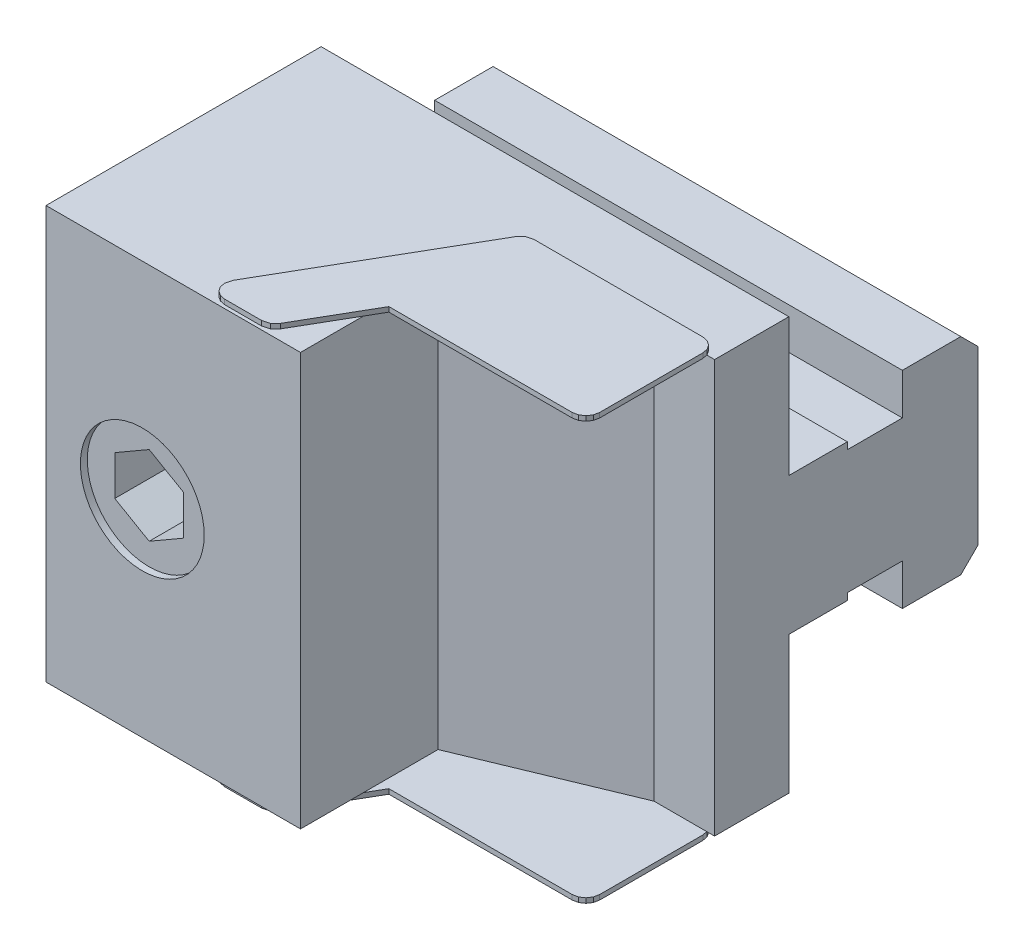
ISO-10303-21;
HEADER;
FILE_DESCRIPTION(('STEP AP214'),'2;1');
FILE_NAME('part.step','',(''),(''),'','','');
FILE_SCHEMA(('AUTOMOTIVE_DESIGN { 1 0 10303 214 1 1 1 1 }'));
ENDSEC;
DATA;
#1=APPLICATION_CONTEXT('core data for automotive mechanical design processes');
#2=APPLICATION_PROTOCOL_DEFINITION('international standard','automotive_design',2000,#1);
#3=PRODUCT_CONTEXT('',#1,'mechanical');
#4=PRODUCT('Part','Part','',(#3));
#5=PRODUCT_RELATED_PRODUCT_CATEGORY('part','',(#4));
#6=PRODUCT_DEFINITION_FORMATION('','',#4);
#7=PRODUCT_DEFINITION_CONTEXT('part definition',#1,'design');
#8=PRODUCT_DEFINITION('design','',#6,#7);
#9=PRODUCT_DEFINITION_SHAPE('','',#8);
#10=(LENGTH_UNIT() NAMED_UNIT(*) SI_UNIT(.MILLI.,.METRE.));
#11=(NAMED_UNIT(*) PLANE_ANGLE_UNIT() SI_UNIT($,.RADIAN.));
#12=(NAMED_UNIT(*) SI_UNIT($,.STERADIAN.) SOLID_ANGLE_UNIT());
#13=UNCERTAINTY_MEASURE_WITH_UNIT(LENGTH_MEASURE(1.E-05),#10,'distance_accuracy_value','');
#14=(GEOMETRIC_REPRESENTATION_CONTEXT(3) GLOBAL_UNCERTAINTY_ASSIGNED_CONTEXT((#13)) GLOBAL_UNIT_ASSIGNED_CONTEXT((#10,
#11,#12)) REPRESENTATION_CONTEXT('',''));
#15=CARTESIAN_POINT('',(0.,0.,0.));
#16=DIRECTION('',(0.,0.,1.));
#17=DIRECTION('',(1.,0.,0.));
#18=AXIS2_PLACEMENT_3D('',#15,#16,#17);
#19=CARTESIAN_POINT('',(68.,-30.,0.));
#20=DIRECTION('',(0.,0.,1.));
#21=DIRECTION('',(1.,0.,0.));
#22=AXIS2_PLACEMENT_3D('',#19,#20,#21);
#23=PLANE('',#22);
#24=DIRECTION('',(-1.,0.,0.));
#25=VECTOR('',#24,1.);
#26=CARTESIAN_POINT('',(68.,-10.,0.));
#27=LINE('',#26,#25);
#28=CARTESIAN_POINT('',(68.,-10.,0.));
#29=VERTEX_POINT('',#28);
#30=CARTESIAN_POINT('',(0.,-10.,0.));
#31=VERTEX_POINT('',#30);
#32=EDGE_CURVE('E605',#29,#31,#27,.T.);
#33=ORIENTED_EDGE('',*,*,#32,.F.);
#34=DIRECTION('',(0.,1.,0.));
#35=VECTOR('',#34,1.);
#36=CARTESIAN_POINT('',(68.,-30.,0.));
#37=LINE('',#36,#35);
#38=CARTESIAN_POINT('',(68.,-30.,0.));
#39=VERTEX_POINT('',#38);
#40=EDGE_CURVE('E1067',#39,#29,#37,.T.);
#41=ORIENTED_EDGE('',*,*,#40,.F.);
#42=DIRECTION('',(-1.,0.,0.));
#43=VECTOR('',#42,1.);
#44=CARTESIAN_POINT('',(68.,-30.,0.));
#45=LINE('',#44,#43);
#46=CARTESIAN_POINT('',(0.,-30.,0.));
#47=VERTEX_POINT('',#46);
#48=EDGE_CURVE('E1054',#39,#47,#45,.T.);
#49=ORIENTED_EDGE('',*,*,#48,.T.);
#50=DIRECTION('',(0.,1.,0.));
#51=VECTOR('',#50,1.);
#52=CARTESIAN_POINT('',(0.,-30.,0.));
#53=LINE('',#52,#51);
#54=EDGE_CURVE('E1052',#47,#31,#53,.T.);
#55=ORIENTED_EDGE('',*,*,#54,.T.);
#56=EDGE_LOOP('',(#33,#41,#49,#55));
#57=FACE_BOUND('',#56,.T.);
#58=ADVANCED_FACE('F14',(#57),#23,.F.);
#59=CARTESIAN_POINT('',(68.,30.,0.));
#60=DIRECTION('',(0.,-1.,0.));
#61=DIRECTION('',(1.,0.,0.));
#62=AXIS2_PLACEMENT_3D('',#59,#60,#61);
#63=PLANE('',#62);
#64=DIRECTION('',(-0.197845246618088,0.,-0.980233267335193));
#65=VECTOR('',#64,1.);
#66=CARTESIAN_POINT('',(67.0016691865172,30.,11.5004214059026));
#67=LINE('',#66,#65);
#68=CARTESIAN_POINT('',(66.8602997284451,30.,10.8));
#69=VERTEX_POINT('',#68);
#70=CARTESIAN_POINT('',(66.8445384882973,30.,10.7219102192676));
#71=VERTEX_POINT('',#70);
#72=EDGE_CURVE('E865',#69,#71,#67,.T.);
#73=ORIENTED_EDGE('',*,*,#72,.F.);
#74=DIRECTION('',(-1.,0.,0.));
#75=VECTOR('',#74,1.);
#76=CARTESIAN_POINT('',(68.,30.,10.8));
#77=LINE('',#76,#75);
#78=CARTESIAN_POINT('',(68.,30.,10.8));
#79=VERTEX_POINT('',#78);
#80=EDGE_CURVE('E1011',#79,#69,#77,.T.);
#81=ORIENTED_EDGE('',*,*,#80,.F.);
#82=DIRECTION('',(0.,0.,1.));
#83=VECTOR('',#82,1.);
#84=CARTESIAN_POINT('',(68.,30.,0.));
#85=LINE('',#84,#83);
#86=CARTESIAN_POINT('',(68.,30.,0.));
#87=VERTEX_POINT('',#86);
#88=EDGE_CURVE('E1064',#87,#79,#85,.T.);
#89=ORIENTED_EDGE('',*,*,#88,.F.);
#90=DIRECTION('',(-1.,0.,0.));
#91=VECTOR('',#90,1.);
#92=CARTESIAN_POINT('',(68.,30.,0.));
#93=LINE('',#92,#91);
#94=CARTESIAN_POINT('',(0.,30.,0.));
#95=VERTEX_POINT('',#94);
#96=EDGE_CURVE('E1057',#87,#95,#93,.T.);
#97=ORIENTED_EDGE('',*,*,#96,.T.);
#98=DIRECTION('',(0.,0.,1.));
#99=VECTOR('',#98,1.);
#100=CARTESIAN_POINT('',(0.,30.,0.));
#101=LINE('',#100,#99);
#102=CARTESIAN_POINT('',(0.,30.,40.));
#103=VERTEX_POINT('',#102);
#104=EDGE_CURVE('E1046',#95,#103,#101,.T.);
#105=ORIENTED_EDGE('',*,*,#104,.T.);
#106=DIRECTION('',(-1.,0.,0.));
#107=VECTOR('',#106,1.);
#108=CARTESIAN_POINT('',(68.,30.,40.));
#109=LINE('',#108,#107);
#110=CARTESIAN_POINT('',(37.,30.,40.));
#111=VERTEX_POINT('',#110);
#112=EDGE_CURVE('E1060',#111,#103,#109,.T.);
#113=ORIENTED_EDGE('',*,*,#112,.F.);
#114=DIRECTION('',(0.,0.,1.));
#115=VECTOR('',#114,1.);
#116=CARTESIAN_POINT('',(37.,30.,40.));
#117=LINE('',#116,#115);
#118=CARTESIAN_POINT('',(37.,30.,30.8442997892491));
#119=VERTEX_POINT('',#118);
#120=EDGE_CURVE('E1014',#119,#111,#117,.T.);
#121=ORIENTED_EDGE('',*,*,#120,.F.);
#122=DIRECTION('',(0.500019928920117,0.,-0.866013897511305));
#123=VECTOR('',#122,1.);
#124=CARTESIAN_POINT('',(38.3526955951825,30.,28.5014867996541));
#125=LINE('',#124,#123);
#126=CARTESIAN_POINT('',(32.5793328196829,30.,38.5007130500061));
#127=VERTEX_POINT('',#126);
#128=EDGE_CURVE('E846',#127,#119,#125,.T.);
#129=ORIENTED_EDGE('',*,*,#128,.F.);
#130=DIRECTION('',(0.707106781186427,0.,-0.707106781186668));
#131=VECTOR('',#130,1.);
#132=CARTESIAN_POINT('',(31.8472466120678,30.,39.2327992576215));
#133=LINE('',#132,#131);
#134=CARTESIAN_POINT('',(31.8472466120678,30.,39.2327992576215));
#135=VERTEX_POINT('',#134);
#136=EDGE_CURVE('E842',#135,#127,#133,.T.);
#137=ORIENTED_EDGE('',*,*,#136,.F.);
#138=DIRECTION('',(0.965948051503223,0.,-0.258736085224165));
#139=VECTOR('',#138,1.);
#140=CARTESIAN_POINT('',(30.8473239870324,30.,39.5006356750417));
#141=LINE('',#140,#139);
#142=CARTESIAN_POINT('',(30.8473239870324,30.,39.5006356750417));
#143=VERTEX_POINT('',#142);
#144=EDGE_CURVE('E839',#143,#135,#141,.T.);
#145=ORIENTED_EDGE('',*,*,#144,.F.);
#146=DIRECTION('',(1.,0.,0.));
#147=VECTOR('',#146,1.);
#148=CARTESIAN_POINT('',(30.8473239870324,30.,39.5006356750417));
#149=LINE('',#148,#147);
#150=CARTESIAN_POINT('',(25.4655975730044,30.,39.5006356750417));
#151=VERTEX_POINT('',#150);
#152=EDGE_CURVE('E836',#151,#143,#149,.T.);
#153=ORIENTED_EDGE('',*,*,#152,.F.);
#154=DIRECTION('',(0.980233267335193,0.,0.197845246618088));
#155=VECTOR('',#154,1.);
#156=CARTESIAN_POINT('',(24.6870863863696,30.,39.3435049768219));
#157=LINE('',#156,#155);
#158=CARTESIAN_POINT('',(24.6870863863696,30.,39.3435049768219));
#159=VERTEX_POINT('',#158);
#160=EDGE_CURVE('E833',#159,#151,#157,.T.);
#161=ORIENTED_EDGE('',*,*,#160,.F.);
#162=DIRECTION('',(0.82917255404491,0.,0.558992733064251));
#163=VECTOR('',#162,1.);
#164=CARTESIAN_POINT('',(24.0514212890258,30.,38.9149667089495));
#165=LINE('',#164,#163);
#166=CARTESIAN_POINT('',(24.0514212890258,30.,38.9149667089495));
#167=VERTEX_POINT('',#166);
#168=EDGE_CURVE('E830',#167,#159,#165,.T.);
#169=ORIENTED_EDGE('',*,*,#168,.F.);
#170=DIRECTION('',(0.558992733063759,0.,0.829172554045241));
#171=VECTOR('',#170,1.);
#172=CARTESIAN_POINT('',(23.6228830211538,30.,38.2793016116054));
#173=LINE('',#172,#171);
#174=CARTESIAN_POINT('',(23.6228830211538,30.,38.2793016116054));
#175=VERTEX_POINT('',#174);
#176=EDGE_CURVE('E827',#175,#167,#173,.T.);
#177=ORIENTED_EDGE('',*,*,#176,.F.);
#178=DIRECTION('',(0.197845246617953,0.,0.98023326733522));
#179=VECTOR('',#178,1.);
#180=CARTESIAN_POINT('',(23.4657523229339,30.,37.5007904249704));
#181=LINE('',#180,#179);
#182=CARTESIAN_POINT('',(23.4657523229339,30.,37.5007904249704));
#183=VERTEX_POINT('',#182);
#184=EDGE_CURVE('E824',#183,#175,#181,.T.);
#185=ORIENTED_EDGE('',*,*,#184,.F.);
#186=DIRECTION('',(-0.258736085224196,0.,0.965948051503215));
#187=VECTOR('',#186,1.);
#188=CARTESIAN_POINT('',(23.7335887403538,30.,36.5008677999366));
#189=LINE('',#188,#187);
#190=CARTESIAN_POINT('',(23.7335887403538,30.,36.5008677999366));
#191=VERTEX_POINT('',#190);
#192=EDGE_CURVE('E821',#191,#183,#189,.T.);
#193=ORIENTED_EDGE('',*,*,#192,.F.);
#194=DIRECTION('',(-0.499985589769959,0.,0.866033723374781));
#195=VECTOR('',#194,1.);
#196=CARTESIAN_POINT('',(23.7335887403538,30.,36.5008677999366));
#197=LINE('',#196,#195);
#198=CARTESIAN_POINT('',(38.7443319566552,30.,10.5004987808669));
#199=VERTEX_POINT('',#198);
#200=EDGE_CURVE('E818',#199,#191,#197,.T.);
#201=ORIENTED_EDGE('',*,*,#200,.F.);
#202=DIRECTION('',(-0.707322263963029,0.,0.706891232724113));
#203=VECTOR('',#202,1.);
#204=CARTESIAN_POINT('',(39.4768645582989,30.,9.76841257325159));
#205=LINE('',#204,#203);
#206=CARTESIAN_POINT('',(39.4768645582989,30.,9.76841257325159));
#207=VERTEX_POINT('',#206);
#208=EDGE_CURVE('E880',#207,#199,#205,.T.);
#209=ORIENTED_EDGE('',*,*,#208,.F.);
#210=DIRECTION('',(-0.965919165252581,0.,0.258843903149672));
#211=VECTOR('',#210,1.);
#212=CARTESIAN_POINT('',(40.4763407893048,30.,9.50057615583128));
#213=LINE('',#212,#211);
#214=CARTESIAN_POINT('',(40.4763407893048,30.,9.50057615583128));
#215=VERTEX_POINT('',#214);
#216=EDGE_CURVE('E877',#215,#207,#213,.T.);
#217=ORIENTED_EDGE('',*,*,#216,.F.);
#218=DIRECTION('',(-1.,0.,0.));
#219=VECTOR('',#218,1.);
#220=CARTESIAN_POINT('',(40.4763407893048,30.,9.50057615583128));
#221=LINE('',#220,#219);
#222=CARTESIAN_POINT('',(65.0018239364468,30.,9.50057615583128));
#223=VERTEX_POINT('',#222);
#224=EDGE_CURVE('E874',#223,#215,#221,.T.);
#225=ORIENTED_EDGE('',*,*,#224,.F.);
#226=DIRECTION('',(-0.980233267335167,0.,-0.197845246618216));
#227=VECTOR('',#226,1.);
#228=CARTESIAN_POINT('',(65.7803351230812,30.,9.65770685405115));
#229=LINE('',#228,#227);
#230=CARTESIAN_POINT('',(65.7803351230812,30.,9.65770685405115));
#231=VERTEX_POINT('',#230);
#232=EDGE_CURVE('E871',#231,#223,#229,.T.);
#233=ORIENTED_EDGE('',*,*,#232,.F.);
#234=DIRECTION('',(-0.829172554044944,0.,-0.558992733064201));
#235=VECTOR('',#234,1.);
#236=CARTESIAN_POINT('',(66.4160002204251,30.,10.0862451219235));
#237=LINE('',#236,#235);
#238=CARTESIAN_POINT('',(66.4160002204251,30.,10.0862451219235));
#239=VERTEX_POINT('',#238);
#240=EDGE_CURVE('E868',#239,#231,#237,.T.);
#241=ORIENTED_EDGE('',*,*,#240,.F.);
#242=DIRECTION('',(-0.558992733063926,0.,-0.82917255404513));
#243=VECTOR('',#242,1.);
#244=CARTESIAN_POINT('',(66.8445384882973,30.,10.7219102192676));
#245=LINE('',#244,#243);
#246=EDGE_CURVE('E864',#71,#239,#245,.T.);
#247=ORIENTED_EDGE('',*,*,#246,.F.);
#248=EDGE_LOOP('',(#73,#81,#89,#97,#105,#113,#121,#129,#137,#145,#153,#161,#169,#177,#185,#193,
#201,#209,#217,#225,#233,#241,#247));
#249=FACE_BOUND('',#248,.T.);
#250=ADVANCED_FACE('F1092',(#249),#63,.F.);
#251=CARTESIAN_POINT('',(68.,-30.,0.));
#252=DIRECTION('',(0.,1.,0.));
#253=DIRECTION('',(-1.,0.,0.));
#254=AXIS2_PLACEMENT_3D('',#251,#252,#253);
#255=PLANE('',#254);
#256=DIRECTION('',(0.707106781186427,0.,-0.707106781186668));
#257=VECTOR('',#256,1.);
#258=CARTESIAN_POINT('',(31.8472466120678,-30.,39.2327992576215));
#259=LINE('',#258,#257);
#260=CARTESIAN_POINT('',(31.8472466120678,-30.,39.2327992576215));
#261=VERTEX_POINT('',#260);
#262=CARTESIAN_POINT('',(32.5793328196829,-30.,38.5007130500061));
#263=VERTEX_POINT('',#262);
#264=EDGE_CURVE('E677',#261,#263,#259,.T.);
#265=ORIENTED_EDGE('',*,*,#264,.T.);
#266=DIRECTION('',(0.500019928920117,0.,-0.866013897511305));
#267=VECTOR('',#266,1.);
#268=CARTESIAN_POINT('',(38.3526955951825,-30.,28.5014867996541));
#269=LINE('',#268,#267);
#270=CARTESIAN_POINT('',(37.,-30.,30.8442997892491));
#271=VERTEX_POINT('',#270);
#272=EDGE_CURVE('E674',#263,#271,#269,.T.);
#273=ORIENTED_EDGE('',*,*,#272,.T.);
#274=DIRECTION('',(0.,0.,1.));
#275=VECTOR('',#274,1.);
#276=CARTESIAN_POINT('',(37.,-30.,40.));
#277=LINE('',#276,#275);
#278=CARTESIAN_POINT('',(37.,-30.,40.));
#279=VERTEX_POINT('',#278);
#280=EDGE_CURVE('E1022',#271,#279,#277,.T.);
#281=ORIENTED_EDGE('',*,*,#280,.T.);
#282=DIRECTION('',(-1.,0.,0.));
#283=VECTOR('',#282,1.);
#284=CARTESIAN_POINT('',(68.,-30.,40.));
#285=LINE('',#284,#283);
#286=CARTESIAN_POINT('',(0.,-30.,40.));
#287=VERTEX_POINT('',#286);
#288=EDGE_CURVE('E1062',#279,#287,#285,.T.);
#289=ORIENTED_EDGE('',*,*,#288,.T.);
#290=DIRECTION('',(0.,0.,-1.));
#291=VECTOR('',#290,1.);
#292=CARTESIAN_POINT('',(0.,-30.,0.));
#293=LINE('',#292,#291);
#294=EDGE_CURVE('E491',#287,#47,#293,.T.);
#295=ORIENTED_EDGE('',*,*,#294,.T.);
#296=ORIENTED_EDGE('',*,*,#48,.F.);
#297=DIRECTION('',(0.,0.,-1.));
#298=VECTOR('',#297,1.);
#299=CARTESIAN_POINT('',(68.,-30.,0.));
#300=LINE('',#299,#298);
#301=CARTESIAN_POINT('',(68.,-30.,10.8));
#302=VERTEX_POINT('',#301);
#303=EDGE_CURVE('E1070',#302,#39,#300,.T.);
#304=ORIENTED_EDGE('',*,*,#303,.F.);
#305=DIRECTION('',(-1.,0.,0.));
#306=VECTOR('',#305,1.);
#307=CARTESIAN_POINT('',(68.,-30.,10.8));
#308=LINE('',#307,#306);
#309=CARTESIAN_POINT('',(66.8602997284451,-30.,10.8));
#310=VERTEX_POINT('',#309);
#311=EDGE_CURVE('E1019',#302,#310,#308,.T.);
#312=ORIENTED_EDGE('',*,*,#311,.T.);
#313=DIRECTION('',(-0.197845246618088,0.,-0.980233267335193));
#314=VECTOR('',#313,1.);
#315=CARTESIAN_POINT('',(67.0016691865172,-30.,11.5004214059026));
#316=LINE('',#315,#314);
#317=CARTESIAN_POINT('',(66.8445384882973,-30.,10.7219102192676));
#318=VERTEX_POINT('',#317);
#319=EDGE_CURVE('E22',#310,#318,#316,.T.);
#320=ORIENTED_EDGE('',*,*,#319,.T.);
#321=DIRECTION('',(-0.558992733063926,0.,-0.82917255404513));
#322=VECTOR('',#321,1.);
#323=CARTESIAN_POINT('',(66.8445384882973,-30.,10.7219102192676));
#324=LINE('',#323,#322);
#325=CARTESIAN_POINT('',(66.4160002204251,-30.,10.0862451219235));
#326=VERTEX_POINT('',#325);
#327=EDGE_CURVE('E649',#318,#326,#324,.T.);
#328=ORIENTED_EDGE('',*,*,#327,.T.);
#329=DIRECTION('',(-0.829172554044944,0.,-0.558992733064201));
#330=VECTOR('',#329,1.);
#331=CARTESIAN_POINT('',(66.4160002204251,-30.,10.0862451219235));
#332=LINE('',#331,#330);
#333=CARTESIAN_POINT('',(65.7803351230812,-30.,9.65770685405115));
#334=VERTEX_POINT('',#333);
#335=EDGE_CURVE('E646',#326,#334,#332,.T.);
#336=ORIENTED_EDGE('',*,*,#335,.T.);
#337=DIRECTION('',(-0.980233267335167,0.,-0.197845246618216));
#338=VECTOR('',#337,1.);
#339=CARTESIAN_POINT('',(65.7803351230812,-30.,9.65770685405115));
#340=LINE('',#339,#338);
#341=CARTESIAN_POINT('',(65.0018239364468,-30.,9.50057615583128));
#342=VERTEX_POINT('',#341);
#343=EDGE_CURVE('E643',#334,#342,#340,.T.);
#344=ORIENTED_EDGE('',*,*,#343,.T.);
#345=DIRECTION('',(-1.,0.,0.));
#346=VECTOR('',#345,1.);
#347=CARTESIAN_POINT('',(40.4763407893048,-30.,9.50057615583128));
#348=LINE('',#347,#346);
#349=CARTESIAN_POINT('',(40.4763407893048,-30.,9.50057615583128));
#350=VERTEX_POINT('',#349);
#351=EDGE_CURVE('E640',#342,#350,#348,.T.);
#352=ORIENTED_EDGE('',*,*,#351,.T.);
#353=DIRECTION('',(-0.965919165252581,0.,0.258843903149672));
#354=VECTOR('',#353,1.);
#355=CARTESIAN_POINT('',(40.4763407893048,-30.,9.50057615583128));
#356=LINE('',#355,#354);
#357=CARTESIAN_POINT('',(39.4768645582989,-30.,9.76841257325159));
#358=VERTEX_POINT('',#357);
#359=EDGE_CURVE('E637',#350,#358,#356,.T.);
#360=ORIENTED_EDGE('',*,*,#359,.T.);
#361=DIRECTION('',(-0.707322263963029,0.,0.706891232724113));
#362=VECTOR('',#361,1.);
#363=CARTESIAN_POINT('',(39.4768645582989,-30.,9.76841257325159));
#364=LINE('',#363,#362);
#365=CARTESIAN_POINT('',(38.7443319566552,-30.,10.5004987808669));
#366=VERTEX_POINT('',#365);
#367=EDGE_CURVE('E634',#358,#366,#364,.T.);
#368=ORIENTED_EDGE('',*,*,#367,.T.);
#369=DIRECTION('',(-0.499985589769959,0.,0.866033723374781));
#370=VECTOR('',#369,1.);
#371=CARTESIAN_POINT('',(23.7335887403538,-30.,36.5008677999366));
#372=LINE('',#371,#370);
#373=CARTESIAN_POINT('',(23.7335887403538,-30.,36.5008677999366));
#374=VERTEX_POINT('',#373);
#375=EDGE_CURVE('E608',#366,#374,#372,.T.);
#376=ORIENTED_EDGE('',*,*,#375,.T.);
#377=DIRECTION('',(-0.258736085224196,0.,0.965948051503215));
#378=VECTOR('',#377,1.);
#379=CARTESIAN_POINT('',(23.7335887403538,-30.,36.5008677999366));
#380=LINE('',#379,#378);
#381=CARTESIAN_POINT('',(23.4657523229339,-30.,37.5007904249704));
#382=VERTEX_POINT('',#381);
#383=EDGE_CURVE('E698',#374,#382,#380,.T.);
#384=ORIENTED_EDGE('',*,*,#383,.T.);
#385=DIRECTION('',(0.197845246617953,0.,0.98023326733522));
#386=VECTOR('',#385,1.);
#387=CARTESIAN_POINT('',(23.4657523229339,-30.,37.5007904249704));
#388=LINE('',#387,#386);
#389=CARTESIAN_POINT('',(23.6228830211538,-30.,38.2793016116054));
#390=VERTEX_POINT('',#389);
#391=EDGE_CURVE('E695',#382,#390,#388,.T.);
#392=ORIENTED_EDGE('',*,*,#391,.T.);
#393=DIRECTION('',(0.558992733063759,0.,0.829172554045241));
#394=VECTOR('',#393,1.);
#395=CARTESIAN_POINT('',(23.6228830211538,-30.,38.2793016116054));
#396=LINE('',#395,#394);
#397=CARTESIAN_POINT('',(24.0514212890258,-30.,38.9149667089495));
#398=VERTEX_POINT('',#397);
#399=EDGE_CURVE('E692',#390,#398,#396,.T.);
#400=ORIENTED_EDGE('',*,*,#399,.T.);
#401=DIRECTION('',(0.82917255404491,0.,0.558992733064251));
#402=VECTOR('',#401,1.);
#403=CARTESIAN_POINT('',(24.0514212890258,-30.,38.9149667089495));
#404=LINE('',#403,#402);
#405=CARTESIAN_POINT('',(24.6870863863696,-30.,39.3435049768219));
#406=VERTEX_POINT('',#405);
#407=EDGE_CURVE('E689',#398,#406,#404,.T.);
#408=ORIENTED_EDGE('',*,*,#407,.T.);
#409=DIRECTION('',(0.980233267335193,0.,0.197845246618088));
#410=VECTOR('',#409,1.);
#411=CARTESIAN_POINT('',(24.6870863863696,-30.,39.3435049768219));
#412=LINE('',#411,#410);
#413=CARTESIAN_POINT('',(25.4655975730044,-30.,39.5006356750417));
#414=VERTEX_POINT('',#413);
#415=EDGE_CURVE('E686',#406,#414,#412,.T.);
#416=ORIENTED_EDGE('',*,*,#415,.T.);
#417=DIRECTION('',(1.,0.,0.));
#418=VECTOR('',#417,1.);
#419=CARTESIAN_POINT('',(30.8473239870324,-30.,39.5006356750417));
#420=LINE('',#419,#418);
#421=CARTESIAN_POINT('',(30.8473239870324,-30.,39.5006356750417));
#422=VERTEX_POINT('',#421);
#423=EDGE_CURVE('E683',#414,#422,#420,.T.);
#424=ORIENTED_EDGE('',*,*,#423,.T.);
#425=DIRECTION('',(0.965948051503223,0.,-0.258736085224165));
#426=VECTOR('',#425,1.);
#427=CARTESIAN_POINT('',(30.8473239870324,-30.,39.5006356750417));
#428=LINE('',#427,#426);
#429=EDGE_CURVE('E680',#422,#261,#428,.T.);
#430=ORIENTED_EDGE('',*,*,#429,.T.);
#431=EDGE_LOOP('',(#265,#273,#281,#289,#295,#296,#304,#312,#320,#328,#336,#344,#352,#360,#368,
#376,#384,#392,#400,#408,#416,#424,#430));
#432=FACE_BOUND('',#431,.T.);
#433=ADVANCED_FACE('F16',(#432),#255,.F.);
#434=CARTESIAN_POINT('',(68.,10.,0.));
#435=VERTEX_POINT('',#434);
#436=EDGE_CURVE('E1073',#435,#87,#37,.T.);
#437=ORIENTED_EDGE('',*,*,#436,.F.);
#438=DIRECTION('',(-1.,0.,0.));
#439=VECTOR('',#438,1.);
#440=CARTESIAN_POINT('',(68.,10.,0.));
#441=LINE('',#440,#439);
#442=CARTESIAN_POINT('',(0.,10.,0.));
#443=VERTEX_POINT('',#442);
#444=EDGE_CURVE('E612',#435,#443,#441,.T.);
#445=ORIENTED_EDGE('',*,*,#444,.T.);
#446=EDGE_CURVE('E1043',#443,#95,#53,.T.);
#447=ORIENTED_EDGE('',*,*,#446,.T.);
#448=ORIENTED_EDGE('',*,*,#96,.F.);
#449=EDGE_LOOP('',(#437,#445,#447,#448));
#450=FACE_BOUND('',#449,.T.);
#451=ADVANCED_FACE('F1239',(#450),#23,.F.);
#452=CARTESIAN_POINT('',(68.,-30.,40.));
#453=DIRECTION('',(0.,0.,-1.));
#454=DIRECTION('',(-1.,0.,0.));
#455=AXIS2_PLACEMENT_3D('',#452,#453,#454);
#456=PLANE('',#455);
#457=CARTESIAN_POINT('',(14.,0.,40.));
#458=DIRECTION('',(0.,0.,1.));
#459=DIRECTION('',(1.,0.,0.));
#460=AXIS2_PLACEMENT_3D('',#457,#458,#459);
#461=CIRCLE('',#460,9.);
#462=CARTESIAN_POINT('',(23.,0.,40.));
#463=VERTEX_POINT('',#462);
#464=EDGE_CURVE('E517',#463,#463,#461,.T.);
#465=ORIENTED_EDGE('',*,*,#464,.F.);
#466=EDGE_LOOP('',(#465));
#467=FACE_BOUND('',#466,.T.);
#468=ORIENTED_EDGE('',*,*,#288,.F.);
#469=DIRECTION('',(0.,1.,0.));
#470=VECTOR('',#469,1.);
#471=CARTESIAN_POINT('',(37.,-30.,40.));
#472=LINE('',#471,#470);
#473=EDGE_CURVE('E1026',#279,#111,#472,.T.);
#474=ORIENTED_EDGE('',*,*,#473,.T.);
#475=ORIENTED_EDGE('',*,*,#112,.T.);
#476=DIRECTION('',(0.,-1.,0.));
#477=VECTOR('',#476,1.);
#478=CARTESIAN_POINT('',(0.,-30.,40.));
#479=LINE('',#478,#477);
#480=EDGE_CURVE('E1080',#103,#287,#479,.T.);
#481=ORIENTED_EDGE('',*,*,#480,.T.);
#482=EDGE_LOOP('',(#468,#474,#475,#481));
#483=FACE_BOUND('',#482,.T.);
#484=ADVANCED_FACE('F1100',(#467,#483),#456,.F.);
#485=CARTESIAN_POINT('',(68.,-30.,40.));
#486=DIRECTION('',(-1.,0.,0.));
#487=DIRECTION('',(0.,-1.,0.));
#488=AXIS2_PLACEMENT_3D('',#485,#486,#487);
#489=PLANE('',#488);
#490=ORIENTED_EDGE('',*,*,#88,.T.);
#491=DIRECTION('',(0.,1.,0.));
#492=VECTOR('',#491,1.);
#493=CARTESIAN_POINT('',(68.,-30.,10.8));
#494=LINE('',#493,#492);
#495=EDGE_CURVE('E1025',#302,#79,#494,.T.);
#496=ORIENTED_EDGE('',*,*,#495,.F.);
#497=ORIENTED_EDGE('',*,*,#303,.T.);
#498=ORIENTED_EDGE('',*,*,#40,.T.);
#499=DIRECTION('',(0.,0.,1.));
#500=VECTOR('',#499,1.);
#501=CARTESIAN_POINT('',(68.,-10.,-8.5));
#502=LINE('',#501,#500);
#503=CARTESIAN_POINT('',(68.,-10.,-8.5));
#504=VERTEX_POINT('',#503);
#505=EDGE_CURVE('E599',#504,#29,#502,.T.);
#506=ORIENTED_EDGE('',*,*,#505,.F.);
#507=DIRECTION('',(0.,-1.,0.));
#508=VECTOR('',#507,1.);
#509=CARTESIAN_POINT('',(68.,-9.,-8.5));
#510=LINE('',#509,#508);
#511=CARTESIAN_POINT('',(68.,-9.,-8.5));
#512=VERTEX_POINT('',#511);
#513=EDGE_CURVE('E596',#512,#504,#510,.T.);
#514=ORIENTED_EDGE('',*,*,#513,.F.);
#515=DIRECTION('',(0.,0.,1.));
#516=VECTOR('',#515,1.);
#517=CARTESIAN_POINT('',(68.,-9.,-16.5));
#518=LINE('',#517,#516);
#519=CARTESIAN_POINT('',(68.,-9.,-16.5));
#520=VERTEX_POINT('',#519);
#521=EDGE_CURVE('E593',#520,#512,#518,.T.);
#522=ORIENTED_EDGE('',*,*,#521,.F.);
#523=DIRECTION('',(0.,1.,0.));
#524=VECTOR('',#523,1.);
#525=CARTESIAN_POINT('',(68.,-15.,-16.5));
#526=LINE('',#525,#524);
#527=CARTESIAN_POINT('',(68.,-15.,-16.5));
#528=VERTEX_POINT('',#527);
#529=EDGE_CURVE('E590',#528,#520,#526,.T.);
#530=ORIENTED_EDGE('',*,*,#529,.F.);
#531=DIRECTION('',(0.,0.,1.));
#532=VECTOR('',#531,1.);
#533=CARTESIAN_POINT('',(68.,-15.,-25.));
#534=LINE('',#533,#532);
#535=CARTESIAN_POINT('',(68.,-15.,-25.));
#536=VERTEX_POINT('',#535);
#537=EDGE_CURVE('E587',#536,#528,#534,.T.);
#538=ORIENTED_EDGE('',*,*,#537,.F.);
#539=DIRECTION('',(0.,-0.707106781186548,0.707106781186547));
#540=VECTOR('',#539,1.);
#541=CARTESIAN_POINT('',(68.,-12.5,-27.5));
#542=LINE('',#541,#540);
#543=CARTESIAN_POINT('',(68.,-12.5,-27.5));
#544=VERTEX_POINT('',#543);
#545=EDGE_CURVE('E584',#544,#536,#542,.T.);
#546=ORIENTED_EDGE('',*,*,#545,.F.);
#547=DIRECTION('',(0.,-1.,0.));
#548=VECTOR('',#547,1.);
#549=CARTESIAN_POINT('',(68.,12.5,-27.5));
#550=LINE('',#549,#548);
#551=CARTESIAN_POINT('',(68.,12.5,-27.5));
#552=VERTEX_POINT('',#551);
#553=EDGE_CURVE('E581',#552,#544,#550,.T.);
#554=ORIENTED_EDGE('',*,*,#553,.F.);
#555=DIRECTION('',(0.,-0.707106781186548,-0.707106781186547));
#556=VECTOR('',#555,1.);
#557=CARTESIAN_POINT('',(68.,12.5,-27.5));
#558=LINE('',#557,#556);
#559=CARTESIAN_POINT('',(68.,15.,-25.));
#560=VERTEX_POINT('',#559);
#561=EDGE_CURVE('E578',#560,#552,#558,.T.);
#562=ORIENTED_EDGE('',*,*,#561,.F.);
#563=DIRECTION('',(0.,0.,-1.));
#564=VECTOR('',#563,1.);
#565=CARTESIAN_POINT('',(68.,15.,-16.5));
#566=LINE('',#565,#564);
#567=CARTESIAN_POINT('',(68.,15.,-16.5));
#568=VERTEX_POINT('',#567);
#569=EDGE_CURVE('E575',#568,#560,#566,.T.);
#570=ORIENTED_EDGE('',*,*,#569,.F.);
#571=DIRECTION('',(0.,1.,0.));
#572=VECTOR('',#571,1.);
#573=CARTESIAN_POINT('',(68.,9.,-16.5));
#574=LINE('',#573,#572);
#575=CARTESIAN_POINT('',(68.,9.,-16.5));
#576=VERTEX_POINT('',#575);
#577=EDGE_CURVE('E572',#576,#568,#574,.T.);
#578=ORIENTED_EDGE('',*,*,#577,.F.);
#579=DIRECTION('',(0.,0.,-1.));
#580=VECTOR('',#579,1.);
#581=CARTESIAN_POINT('',(68.,9.,-8.5));
#582=LINE('',#581,#580);
#583=CARTESIAN_POINT('',(68.,9.,-8.5));
#584=VERTEX_POINT('',#583);
#585=EDGE_CURVE('E568',#584,#576,#582,.T.);
#586=ORIENTED_EDGE('',*,*,#585,.F.);
#587=DIRECTION('',(0.,-1.,0.));
#588=VECTOR('',#587,1.);
#589=CARTESIAN_POINT('',(68.,10.,-8.5));
#590=LINE('',#589,#588);
#591=CARTESIAN_POINT('',(68.,10.,-8.5));
#592=VERTEX_POINT('',#591);
#593=EDGE_CURVE('E565',#592,#584,#590,.T.);
#594=ORIENTED_EDGE('',*,*,#593,.F.);
#595=DIRECTION('',(0.,0.,-1.));
#596=VECTOR('',#595,1.);
#597=CARTESIAN_POINT('',(68.,10.,0.));
#598=LINE('',#597,#596);
#599=EDGE_CURVE('E569',#435,#592,#598,.T.);
#600=ORIENTED_EDGE('',*,*,#599,.F.);
#601=ORIENTED_EDGE('',*,*,#436,.T.);
#602=EDGE_LOOP('',(#490,#496,#497,#498,#506,#514,#522,#530,#538,#546,#554,#562,#570,#578,#586,
#594,#600,#601));
#603=FACE_BOUND('',#602,.T.);
#604=ADVANCED_FACE('F1253',(#603),#489,.F.);
#605=CARTESIAN_POINT('',(0.,-30.,40.));
#606=DIRECTION('',(-1.,0.,0.));
#607=DIRECTION('',(0.,-1.,0.));
#608=AXIS2_PLACEMENT_3D('',#605,#606,#607);
#609=PLANE('',#608);
#610=ORIENTED_EDGE('',*,*,#294,.F.);
#611=ORIENTED_EDGE('',*,*,#480,.F.);
#612=ORIENTED_EDGE('',*,*,#104,.F.);
#613=ORIENTED_EDGE('',*,*,#446,.F.);
#614=DIRECTION('',(0.,0.,-1.));
#615=VECTOR('',#614,1.);
#616=CARTESIAN_POINT('',(0.,10.,0.));
#617=LINE('',#616,#615);
#618=CARTESIAN_POINT('',(0.,10.,-8.5));
#619=VERTEX_POINT('',#618);
#620=EDGE_CURVE('E36',#443,#619,#617,.T.);
#621=ORIENTED_EDGE('',*,*,#620,.T.);
#622=DIRECTION('',(0.,-1.,0.));
#623=VECTOR('',#622,1.);
#624=CARTESIAN_POINT('',(0.,10.,-8.5));
#625=LINE('',#624,#623);
#626=CARTESIAN_POINT('',(0.,9.,-8.5));
#627=VERTEX_POINT('',#626);
#628=EDGE_CURVE('E531',#619,#627,#625,.T.);
#629=ORIENTED_EDGE('',*,*,#628,.T.);
#630=DIRECTION('',(0.,0.,-1.));
#631=VECTOR('',#630,1.);
#632=CARTESIAN_POINT('',(0.,9.,-8.5));
#633=LINE('',#632,#631);
#634=CARTESIAN_POINT('',(0.,9.,-16.5));
#635=VERTEX_POINT('',#634);
#636=EDGE_CURVE('E534',#627,#635,#633,.T.);
#637=ORIENTED_EDGE('',*,*,#636,.T.);
#638=DIRECTION('',(0.,1.,0.));
#639=VECTOR('',#638,1.);
#640=CARTESIAN_POINT('',(0.,9.,-16.5));
#641=LINE('',#640,#639);
#642=CARTESIAN_POINT('',(0.,15.,-16.5));
#643=VERTEX_POINT('',#642);
#644=EDGE_CURVE('E537',#635,#643,#641,.T.);
#645=ORIENTED_EDGE('',*,*,#644,.T.);
#646=DIRECTION('',(0.,0.,-1.));
#647=VECTOR('',#646,1.);
#648=CARTESIAN_POINT('',(0.,15.,-16.5));
#649=LINE('',#648,#647);
#650=CARTESIAN_POINT('',(0.,15.,-25.));
#651=VERTEX_POINT('',#650);
#652=EDGE_CURVE('E540',#643,#651,#649,.T.);
#653=ORIENTED_EDGE('',*,*,#652,.T.);
#654=DIRECTION('',(0.,-0.707106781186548,-0.707106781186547));
#655=VECTOR('',#654,1.);
#656=CARTESIAN_POINT('',(0.,12.5,-27.5));
#657=LINE('',#656,#655);
#658=CARTESIAN_POINT('',(0.,12.5,-27.5));
#659=VERTEX_POINT('',#658);
#660=EDGE_CURVE('E543',#651,#659,#657,.T.);
#661=ORIENTED_EDGE('',*,*,#660,.T.);
#662=DIRECTION('',(0.,-1.,0.));
#663=VECTOR('',#662,1.);
#664=CARTESIAN_POINT('',(0.,12.5,-27.5));
#665=LINE('',#664,#663);
#666=CARTESIAN_POINT('',(0.,-12.5,-27.5));
#667=VERTEX_POINT('',#666);
#668=EDGE_CURVE('E546',#659,#667,#665,.T.);
#669=ORIENTED_EDGE('',*,*,#668,.T.);
#670=DIRECTION('',(0.,-0.707106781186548,0.707106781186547));
#671=VECTOR('',#670,1.);
#672=CARTESIAN_POINT('',(0.,-12.5,-27.5));
#673=LINE('',#672,#671);
#674=CARTESIAN_POINT('',(0.,-15.,-25.));
#675=VERTEX_POINT('',#674);
#676=EDGE_CURVE('E549',#667,#675,#673,.T.);
#677=ORIENTED_EDGE('',*,*,#676,.T.);
#678=DIRECTION('',(0.,0.,1.));
#679=VECTOR('',#678,1.);
#680=CARTESIAN_POINT('',(0.,-15.,-25.));
#681=LINE('',#680,#679);
#682=CARTESIAN_POINT('',(0.,-15.,-16.5));
#683=VERTEX_POINT('',#682);
#684=EDGE_CURVE('E552',#675,#683,#681,.T.);
#685=ORIENTED_EDGE('',*,*,#684,.T.);
#686=DIRECTION('',(0.,1.,0.));
#687=VECTOR('',#686,1.);
#688=CARTESIAN_POINT('',(0.,-15.,-16.5));
#689=LINE('',#688,#687);
#690=CARTESIAN_POINT('',(0.,-9.,-16.5));
#691=VERTEX_POINT('',#690);
#692=EDGE_CURVE('E555',#683,#691,#689,.T.);
#693=ORIENTED_EDGE('',*,*,#692,.T.);
#694=DIRECTION('',(0.,0.,1.));
#695=VECTOR('',#694,1.);
#696=CARTESIAN_POINT('',(0.,-9.,-16.5));
#697=LINE('',#696,#695);
#698=CARTESIAN_POINT('',(0.,-9.,-8.5));
#699=VERTEX_POINT('',#698);
#700=EDGE_CURVE('E558',#691,#699,#697,.T.);
#701=ORIENTED_EDGE('',*,*,#700,.T.);
#702=DIRECTION('',(0.,-1.,0.));
#703=VECTOR('',#702,1.);
#704=CARTESIAN_POINT('',(0.,-9.,-8.5));
#705=LINE('',#704,#703);
#706=CARTESIAN_POINT('',(0.,-10.,-8.5));
#707=VERTEX_POINT('',#706);
#708=EDGE_CURVE('E561',#699,#707,#705,.T.);
#709=ORIENTED_EDGE('',*,*,#708,.T.);
#710=DIRECTION('',(0.,0.,1.));
#711=VECTOR('',#710,1.);
#712=CARTESIAN_POINT('',(0.,-10.,-8.5));
#713=LINE('',#712,#711);
#714=EDGE_CURVE('E564',#707,#31,#713,.T.);
#715=ORIENTED_EDGE('',*,*,#714,.T.);
#716=ORIENTED_EDGE('',*,*,#54,.F.);
#717=EDGE_LOOP('',(#610,#611,#612,#613,#621,#629,#637,#645,#653,#661,#669,#677,#685,#693,#701,
#709,#715,#716));
#718=FACE_BOUND('',#717,.T.);
#719=ADVANCED_FACE('F1095',(#718),#609,.T.);
#720=CARTESIAN_POINT('',(37.,-30.,40.));
#721=DIRECTION('',(-1.,0.,0.));
#722=DIRECTION('',(0.,-1.,0.));
#723=AXIS2_PLACEMENT_3D('',#720,#721,#722);
#724=PLANE('',#723);
#725=CARTESIAN_POINT('',(37.,-30.,20.));
#726=VERTEX_POINT('',#725);
#727=EDGE_CURVE('E1023',#726,#271,#277,.T.);
#728=ORIENTED_EDGE('',*,*,#727,.F.);
#729=DIRECTION('',(0.,1.,0.));
#730=VECTOR('',#729,1.);
#731=CARTESIAN_POINT('',(37.,-54.0407585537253,20.));
#732=LINE('',#731,#730);
#733=CARTESIAN_POINT('',(37.,30.,20.));
#734=VERTEX_POINT('',#733);
#735=EDGE_CURVE('E1006',#726,#734,#732,.T.);
#736=ORIENTED_EDGE('',*,*,#735,.T.);
#737=EDGE_CURVE('E1015',#734,#119,#117,.T.);
#738=ORIENTED_EDGE('',*,*,#737,.T.);
#739=ORIENTED_EDGE('',*,*,#120,.T.);
#740=ORIENTED_EDGE('',*,*,#473,.F.);
#741=ORIENTED_EDGE('',*,*,#280,.F.);
#742=EDGE_LOOP('',(#728,#736,#738,#739,#740,#741));
#743=FACE_BOUND('',#742,.T.);
#744=ADVANCED_FACE('F1103',(#743),#724,.F.);
#745=CARTESIAN_POINT('',(68.,-30.,10.8));
#746=DIRECTION('',(0.,0.,-1.));
#747=DIRECTION('',(-1.,0.,0.));
#748=AXIS2_PLACEMENT_3D('',#745,#746,#747);
#749=PLANE('',#748);
#750=ORIENTED_EDGE('',*,*,#80,.T.);
#751=CARTESIAN_POINT('',(59.2107647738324,30.,10.8));
#752=VERTEX_POINT('',#751);
#753=EDGE_CURVE('E1002',#69,#752,#77,.T.);
#754=ORIENTED_EDGE('',*,*,#753,.T.);
#755=DIRECTION('',(0.,1.,0.));
#756=VECTOR('',#755,1.);
#757=CARTESIAN_POINT('',(59.2107647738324,-54.0407585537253,10.8));
#758=LINE('',#757,#756);
#759=CARTESIAN_POINT('',(59.2107647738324,-30.,10.8));
#760=VERTEX_POINT('',#759);
#761=EDGE_CURVE('E1003',#760,#752,#758,.T.);
#762=ORIENTED_EDGE('',*,*,#761,.F.);
#763=EDGE_CURVE('E1018',#310,#760,#308,.T.);
#764=ORIENTED_EDGE('',*,*,#763,.F.);
#765=ORIENTED_EDGE('',*,*,#311,.F.);
#766=ORIENTED_EDGE('',*,*,#495,.T.);
#767=EDGE_LOOP('',(#750,#754,#762,#764,#765,#766));
#768=FACE_BOUND('',#767,.T.);
#769=ADVANCED_FACE('F1192',(#768),#749,.F.);
#770=CARTESIAN_POINT('',(59.2107647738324,-54.0407585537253,10.8));
#771=DIRECTION('',(0.382683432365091,0.,0.923879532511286));
#772=DIRECTION('',(0.923879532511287,0.,-0.382683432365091));
#773=AXIS2_PLACEMENT_3D('',#770,#771,#772);
#774=PLANE('',#773);
#775=DIRECTION('',(-0.923879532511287,0.,0.382683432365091));
#776=VECTOR('',#775,1.);
#777=CARTESIAN_POINT('',(59.2107647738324,-30.,10.8));
#778=LINE('',#777,#776);
#779=EDGE_CURVE('E1000',#760,#726,#778,.T.);
#780=ORIENTED_EDGE('',*,*,#779,.F.);
#781=ORIENTED_EDGE('',*,*,#761,.T.);
#782=DIRECTION('',(0.923879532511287,0.,-0.382683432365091));
#783=VECTOR('',#782,1.);
#784=CARTESIAN_POINT('',(59.2107647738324,30.,10.8));
#785=LINE('',#784,#783);
#786=EDGE_CURVE('E999',#734,#752,#785,.T.);
#787=ORIENTED_EDGE('',*,*,#786,.F.);
#788=ORIENTED_EDGE('',*,*,#735,.F.);
#789=EDGE_LOOP('',(#780,#781,#787,#788));
#790=FACE_BOUND('',#789,.T.);
#791=ADVANCED_FACE('F1195',(#790),#774,.T.);
#792=CARTESIAN_POINT('',(23.7335887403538,30.7,36.5008677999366));
#793=DIRECTION('',(0.866033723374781,0.,0.499985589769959));
#794=DIRECTION('',(0.499985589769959,0.,-0.866033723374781));
#795=AXIS2_PLACEMENT_3D('',#792,#793,#794);
#796=PLANE('',#795);
#797=ORIENTED_EDGE('',*,*,#200,.T.);
#798=DIRECTION('',(0.,-1.,0.));
#799=VECTOR('',#798,1.);
#800=CARTESIAN_POINT('',(23.7335887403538,30.7,36.5008677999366));
#801=LINE('',#800,#799);
#802=CARTESIAN_POINT('',(23.7335887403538,30.7,36.5008677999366));
#803=VERTEX_POINT('',#802);
#804=EDGE_CURVE('E996',#803,#191,#801,.T.);
#805=ORIENTED_EDGE('',*,*,#804,.F.);
#806=DIRECTION('',(-0.499985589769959,0.,0.866033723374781));
#807=VECTOR('',#806,1.);
#808=CARTESIAN_POINT('',(23.7335887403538,30.7,36.5008677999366));
#809=LINE('',#808,#807);
#810=CARTESIAN_POINT('',(38.7443319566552,30.7,10.5004987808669));
#811=VERTEX_POINT('',#810);
#812=EDGE_CURVE('E883',#811,#803,#809,.T.);
#813=ORIENTED_EDGE('',*,*,#812,.F.);
#814=DIRECTION('',(0.,-1.,0.));
#815=VECTOR('',#814,1.);
#816=CARTESIAN_POINT('',(38.7443319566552,30.7,10.5004987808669));
#817=LINE('',#816,#815);
#818=EDGE_CURVE('E930',#811,#199,#817,.T.);
#819=ORIENTED_EDGE('',*,*,#818,.T.);
#820=EDGE_LOOP('',(#797,#805,#813,#819));
#821=FACE_BOUND('',#820,.T.);
#822=ADVANCED_FACE('F1153',(#821),#796,.F.);
#823=CARTESIAN_POINT('',(23.7335887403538,30.7,36.5008677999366));
#824=DIRECTION('',(0.965948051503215,0.,0.258736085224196));
#825=DIRECTION('',(0.258736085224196,0.,-0.965948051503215));
#826=AXIS2_PLACEMENT_3D('',#823,#824,#825);
#827=PLANE('',#826);
#828=ORIENTED_EDGE('',*,*,#192,.T.);
#829=DIRECTION('',(0.,-1.,0.));
#830=VECTOR('',#829,1.);
#831=CARTESIAN_POINT('',(23.4657523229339,30.7,37.5007904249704));
#832=LINE('',#831,#830);
#833=CARTESIAN_POINT('',(23.4657523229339,30.7,37.5007904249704));
#834=VERTEX_POINT('',#833);
#835=EDGE_CURVE('E993',#834,#183,#832,.T.);
#836=ORIENTED_EDGE('',*,*,#835,.F.);
#837=DIRECTION('',(-0.258736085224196,0.,0.965948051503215));
#838=VECTOR('',#837,1.);
#839=CARTESIAN_POINT('',(23.7335887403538,30.7,36.5008677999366));
#840=LINE('',#839,#838);
#841=EDGE_CURVE('E886',#803,#834,#840,.T.);
#842=ORIENTED_EDGE('',*,*,#841,.F.);
#843=ORIENTED_EDGE('',*,*,#804,.T.);
#844=EDGE_LOOP('',(#828,#836,#842,#843));
#845=FACE_BOUND('',#844,.T.);
#846=ADVANCED_FACE('F1144',(#845),#827,.F.);
#847=CARTESIAN_POINT('',(23.4657523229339,30.7,37.5007904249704));
#848=DIRECTION('',(0.98023326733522,0.,-0.197845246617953));
#849=DIRECTION('',(-0.197845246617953,0.,-0.98023326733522));
#850=AXIS2_PLACEMENT_3D('',#847,#848,#849);
#851=PLANE('',#850);
#852=ORIENTED_EDGE('',*,*,#184,.T.);
#853=DIRECTION('',(0.,-1.,0.));
#854=VECTOR('',#853,1.);
#855=CARTESIAN_POINT('',(23.6228830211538,30.7,38.2793016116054));
#856=LINE('',#855,#854);
#857=CARTESIAN_POINT('',(23.6228830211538,30.7,38.2793016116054));
#858=VERTEX_POINT('',#857);
#859=EDGE_CURVE('E990',#858,#175,#856,.T.);
#860=ORIENTED_EDGE('',*,*,#859,.F.);
#861=DIRECTION('',(0.197845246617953,0.,0.98023326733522));
#862=VECTOR('',#861,1.);
#863=CARTESIAN_POINT('',(23.4657523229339,30.7,37.5007904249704));
#864=LINE('',#863,#862);
#865=EDGE_CURVE('E888',#834,#858,#864,.T.);
#866=ORIENTED_EDGE('',*,*,#865,.F.);
#867=ORIENTED_EDGE('',*,*,#835,.T.);
#868=EDGE_LOOP('',(#852,#860,#866,#867));
#869=FACE_BOUND('',#868,.T.);
#870=ADVANCED_FACE('F1140',(#869),#851,.F.);
#871=CARTESIAN_POINT('',(23.6228830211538,30.7,38.2793016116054));
#872=DIRECTION('',(0.829172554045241,0.,-0.55899273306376));
#873=DIRECTION('',(-0.55899273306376,0.,-0.829172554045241));
#874=AXIS2_PLACEMENT_3D('',#871,#872,#873);
#875=PLANE('',#874);
#876=ORIENTED_EDGE('',*,*,#176,.T.);
#877=DIRECTION('',(0.,-1.,0.));
#878=VECTOR('',#877,1.);
#879=CARTESIAN_POINT('',(24.0514212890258,30.7,38.9149667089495));
#880=LINE('',#879,#878);
#881=CARTESIAN_POINT('',(24.0514212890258,30.7,38.9149667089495));
#882=VERTEX_POINT('',#881);
#883=EDGE_CURVE('E987',#882,#167,#880,.T.);
#884=ORIENTED_EDGE('',*,*,#883,.F.);
#885=DIRECTION('',(0.558992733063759,0.,0.829172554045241));
#886=VECTOR('',#885,1.);
#887=CARTESIAN_POINT('',(23.6228830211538,30.7,38.2793016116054));
#888=LINE('',#887,#886);
#889=EDGE_CURVE('E890',#858,#882,#888,.T.);
#890=ORIENTED_EDGE('',*,*,#889,.F.);
#891=ORIENTED_EDGE('',*,*,#859,.T.);
#892=EDGE_LOOP('',(#876,#884,#890,#891));
#893=FACE_BOUND('',#892,.T.);
#894=ADVANCED_FACE('F1137',(#893),#875,.F.);
#895=CARTESIAN_POINT('',(24.0514212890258,30.7,38.9149667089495));
#896=DIRECTION('',(0.558992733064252,0.,-0.82917255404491));
#897=DIRECTION('',(-0.82917255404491,0.,-0.558992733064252));
#898=AXIS2_PLACEMENT_3D('',#895,#896,#897);
#899=PLANE('',#898);
#900=ORIENTED_EDGE('',*,*,#168,.T.);
#901=DIRECTION('',(0.,-1.,0.));
#902=VECTOR('',#901,1.);
#903=CARTESIAN_POINT('',(24.6870863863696,30.7,39.3435049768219));
#904=LINE('',#903,#902);
#905=CARTESIAN_POINT('',(24.6870863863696,30.7,39.3435049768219));
#906=VERTEX_POINT('',#905);
#907=EDGE_CURVE('E984',#906,#159,#904,.T.);
#908=ORIENTED_EDGE('',*,*,#907,.F.);
#909=DIRECTION('',(0.82917255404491,0.,0.558992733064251));
#910=VECTOR('',#909,1.);
#911=CARTESIAN_POINT('',(24.0514212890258,30.7,38.9149667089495));
#912=LINE('',#911,#910);
#913=EDGE_CURVE('E892',#882,#906,#912,.T.);
#914=ORIENTED_EDGE('',*,*,#913,.F.);
#915=ORIENTED_EDGE('',*,*,#883,.T.);
#916=EDGE_LOOP('',(#900,#908,#914,#915));
#917=FACE_BOUND('',#916,.T.);
#918=ADVANCED_FACE('F1132',(#917),#899,.F.);
#919=CARTESIAN_POINT('',(24.6870863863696,30.7,39.3435049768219));
#920=DIRECTION('',(0.197845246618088,0.,-0.980233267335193));
#921=DIRECTION('',(-0.980233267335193,0.,-0.197845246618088));
#922=AXIS2_PLACEMENT_3D('',#919,#920,#921);
#923=PLANE('',#922);
#924=ORIENTED_EDGE('',*,*,#160,.T.);
#925=DIRECTION('',(0.,-1.,0.));
#926=VECTOR('',#925,1.);
#927=CARTESIAN_POINT('',(25.4655975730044,30.7,39.5006356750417));
#928=LINE('',#927,#926);
#929=CARTESIAN_POINT('',(25.4655975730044,30.7,39.5006356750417));
#930=VERTEX_POINT('',#929);
#931=EDGE_CURVE('E981',#930,#151,#928,.T.);
#932=ORIENTED_EDGE('',*,*,#931,.F.);
#933=DIRECTION('',(0.980233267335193,0.,0.197845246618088));
#934=VECTOR('',#933,1.);
#935=CARTESIAN_POINT('',(24.6870863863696,30.7,39.3435049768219));
#936=LINE('',#935,#934);
#937=EDGE_CURVE('E894',#906,#930,#936,.T.);
#938=ORIENTED_EDGE('',*,*,#937,.F.);
#939=ORIENTED_EDGE('',*,*,#907,.T.);
#940=EDGE_LOOP('',(#924,#932,#938,#939));
#941=FACE_BOUND('',#940,.T.);
#942=ADVANCED_FACE('F1129',(#941),#923,.F.);
#943=CARTESIAN_POINT('',(30.8473239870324,30.7,39.5006356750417));
#944=DIRECTION('',(0.,0.,-1.));
#945=DIRECTION('',(-1.,0.,0.));
#946=AXIS2_PLACEMENT_3D('',#943,#944,#945);
#947=PLANE('',#946);
#948=ORIENTED_EDGE('',*,*,#152,.T.);
#949=DIRECTION('',(0.,-1.,0.));
#950=VECTOR('',#949,1.);
#951=CARTESIAN_POINT('',(30.8473239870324,30.7,39.5006356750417));
#952=LINE('',#951,#950);
#953=CARTESIAN_POINT('',(30.8473239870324,30.7,39.5006356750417));
#954=VERTEX_POINT('',#953);
#955=EDGE_CURVE('E978',#954,#143,#952,.T.);
#956=ORIENTED_EDGE('',*,*,#955,.F.);
#957=DIRECTION('',(1.,0.,0.));
#958=VECTOR('',#957,1.);
#959=CARTESIAN_POINT('',(30.8473239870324,30.7,39.5006356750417));
#960=LINE('',#959,#958);
#961=EDGE_CURVE('E896',#930,#954,#960,.T.);
#962=ORIENTED_EDGE('',*,*,#961,.F.);
#963=ORIENTED_EDGE('',*,*,#931,.T.);
#964=EDGE_LOOP('',(#948,#956,#962,#963));
#965=FACE_BOUND('',#964,.T.);
#966=ADVANCED_FACE('F1125',(#965),#947,.F.);
#967=CARTESIAN_POINT('',(30.8473239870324,30.7,39.5006356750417));
#968=DIRECTION('',(-0.258736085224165,0.,-0.965948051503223));
#969=DIRECTION('',(-0.965948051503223,0.,0.258736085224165));
#970=AXIS2_PLACEMENT_3D('',#967,#968,#969);
#971=PLANE('',#970);
#972=ORIENTED_EDGE('',*,*,#144,.T.);
#973=DIRECTION('',(0.,-1.,0.));
#974=VECTOR('',#973,1.);
#975=CARTESIAN_POINT('',(31.8472466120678,30.7,39.2327992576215));
#976=LINE('',#975,#974);
#977=CARTESIAN_POINT('',(31.8472466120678,30.7,39.2327992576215));
#978=VERTEX_POINT('',#977);
#979=EDGE_CURVE('E975',#978,#135,#976,.T.);
#980=ORIENTED_EDGE('',*,*,#979,.F.);
#981=DIRECTION('',(0.965948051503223,0.,-0.258736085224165));
#982=VECTOR('',#981,1.);
#983=CARTESIAN_POINT('',(30.8473239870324,30.7,39.5006356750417));
#984=LINE('',#983,#982);
#985=EDGE_CURVE('E898',#954,#978,#984,.T.);
#986=ORIENTED_EDGE('',*,*,#985,.F.);
#987=ORIENTED_EDGE('',*,*,#955,.T.);
#988=EDGE_LOOP('',(#972,#980,#986,#987));
#989=FACE_BOUND('',#988,.T.);
#990=ADVANCED_FACE('F1123',(#989),#971,.F.);
#991=CARTESIAN_POINT('',(31.8472466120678,30.7,39.2327992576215));
#992=DIRECTION('',(-0.707106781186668,0.,-0.707106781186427));
#993=DIRECTION('',(-0.707106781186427,0.,0.707106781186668));
#994=AXIS2_PLACEMENT_3D('',#991,#992,#993);
#995=PLANE('',#994);
#996=ORIENTED_EDGE('',*,*,#136,.T.);
#997=DIRECTION('',(0.,-1.,0.));
#998=VECTOR('',#997,1.);
#999=CARTESIAN_POINT('',(32.5793328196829,30.7,38.5007130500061));
#1000=LINE('',#999,#998);
#1001=CARTESIAN_POINT('',(32.5793328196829,30.7,38.5007130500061));
#1002=VERTEX_POINT('',#1001);
#1003=EDGE_CURVE('E972',#1002,#127,#1000,.T.);
#1004=ORIENTED_EDGE('',*,*,#1003,.F.);
#1005=DIRECTION('',(0.707106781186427,0.,-0.707106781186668));
#1006=VECTOR('',#1005,1.);
#1007=CARTESIAN_POINT('',(31.8472466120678,30.7,39.2327992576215));
#1008=LINE('',#1007,#1006);
#1009=EDGE_CURVE('E900',#978,#1002,#1008,.T.);
#1010=ORIENTED_EDGE('',*,*,#1009,.F.);
#1011=ORIENTED_EDGE('',*,*,#979,.T.);
#1012=EDGE_LOOP('',(#996,#1004,#1010,#1011));
#1013=FACE_BOUND('',#1012,.T.);
#1014=ADVANCED_FACE('F1109',(#1013),#995,.F.);
#1015=CARTESIAN_POINT('',(38.3526955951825,30.7,28.5014867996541));
#1016=DIRECTION('',(-0.866013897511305,0.,-0.500019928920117));
#1017=DIRECTION('',(-0.500019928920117,0.,0.866013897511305));
#1018=AXIS2_PLACEMENT_3D('',#1015,#1016,#1017);
#1019=PLANE('',#1018);
#1020=ORIENTED_EDGE('',*,*,#128,.T.);
#1021=CARTESIAN_POINT('',(38.3526955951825,30.,28.5014867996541));
#1022=VERTEX_POINT('',#1021);
#1023=EDGE_CURVE('E845',#119,#1022,#125,.T.);
#1024=ORIENTED_EDGE('',*,*,#1023,.T.);
#1025=DIRECTION('',(0.,-1.,0.));
#1026=VECTOR('',#1025,1.);
#1027=CARTESIAN_POINT('',(38.3526955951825,30.7,28.5014867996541));
#1028=LINE('',#1027,#1026);
#1029=CARTESIAN_POINT('',(38.3526955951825,30.7,28.5014867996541));
#1030=VERTEX_POINT('',#1029);
#1031=EDGE_CURVE('E969',#1030,#1022,#1028,.T.);
#1032=ORIENTED_EDGE('',*,*,#1031,.F.);
#1033=DIRECTION('',(0.500019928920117,0.,-0.866013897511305));
#1034=VECTOR('',#1033,1.);
#1035=CARTESIAN_POINT('',(38.3526955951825,30.7,28.5014867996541));
#1036=LINE('',#1035,#1034);
#1037=EDGE_CURVE('E902',#1002,#1030,#1036,.T.);
#1038=ORIENTED_EDGE('',*,*,#1037,.F.);
#1039=ORIENTED_EDGE('',*,*,#1003,.T.);
#1040=EDGE_LOOP('',(#1020,#1024,#1032,#1038,#1039));
#1041=FACE_BOUND('',#1040,.T.);
#1042=ADVANCED_FACE('F1113',(#1041),#1019,.F.);
#1043=CARTESIAN_POINT('',(65.0018239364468,30.7,28.5014867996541));
#1044=DIRECTION('',(0.,0.,-1.));
#1045=DIRECTION('',(-1.,0.,0.));
#1046=AXIS2_PLACEMENT_3D('',#1043,#1044,#1045);
#1047=PLANE('',#1046);
#1048=DIRECTION('',(1.,0.,0.));
#1049=VECTOR('',#1048,1.);
#1050=CARTESIAN_POINT('',(65.0018239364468,30.,28.5014867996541));
#1051=LINE('',#1050,#1049);
#1052=CARTESIAN_POINT('',(65.0018239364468,30.,28.5014867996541));
#1053=VERTEX_POINT('',#1052);
#1054=EDGE_CURVE('E849',#1022,#1053,#1051,.T.);
#1055=ORIENTED_EDGE('',*,*,#1054,.T.);
#1056=DIRECTION('',(0.,-1.,0.));
#1057=VECTOR('',#1056,1.);
#1058=CARTESIAN_POINT('',(65.0018239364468,30.7,28.5014867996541));
#1059=LINE('',#1058,#1057);
#1060=CARTESIAN_POINT('',(65.0018239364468,30.7,28.5014867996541));
#1061=VERTEX_POINT('',#1060);
#1062=EDGE_CURVE('E966',#1061,#1053,#1059,.T.);
#1063=ORIENTED_EDGE('',*,*,#1062,.F.);
#1064=DIRECTION('',(1.,0.,0.));
#1065=VECTOR('',#1064,1.);
#1066=CARTESIAN_POINT('',(65.0018239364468,30.7,28.5014867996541));
#1067=LINE('',#1066,#1065);
#1068=EDGE_CURVE('E904',#1030,#1061,#1067,.T.);
#1069=ORIENTED_EDGE('',*,*,#1068,.F.);
#1070=ORIENTED_EDGE('',*,*,#1031,.T.);
#1071=EDGE_LOOP('',(#1055,#1063,#1069,#1070));
#1072=FACE_BOUND('',#1071,.T.);
#1073=ADVANCED_FACE('F1202',(#1072),#1047,.F.);
#1074=CARTESIAN_POINT('',(65.0018239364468,30.7,28.5014867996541));
#1075=DIRECTION('',(-0.198070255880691,0.,-0.98018782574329));
#1076=DIRECTION('',(-0.98018782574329,0.,0.198070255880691));
#1077=AXIS2_PLACEMENT_3D('',#1074,#1075,#1076);
#1078=PLANE('',#1077);
#1079=DIRECTION('',(0.98018782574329,0.,-0.198070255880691));
#1080=VECTOR('',#1079,1.);
#1081=CARTESIAN_POINT('',(65.0018239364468,30.,28.5014867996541));
#1082=LINE('',#1081,#1080);
#1083=CARTESIAN_POINT('',(65.7803351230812,30.,28.3441701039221));
#1084=VERTEX_POINT('',#1083);
#1085=EDGE_CURVE('E851',#1053,#1084,#1082,.T.);
#1086=ORIENTED_EDGE('',*,*,#1085,.T.);
#1087=DIRECTION('',(0.,-1.,0.));
#1088=VECTOR('',#1087,1.);
#1089=CARTESIAN_POINT('',(65.7803351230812,30.7,28.3441701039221));
#1090=LINE('',#1089,#1088);
#1091=CARTESIAN_POINT('',(65.7803351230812,30.7,28.3441701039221));
#1092=VERTEX_POINT('',#1091);
#1093=EDGE_CURVE('E963',#1092,#1084,#1090,.T.);
#1094=ORIENTED_EDGE('',*,*,#1093,.F.);
#1095=DIRECTION('',(0.98018782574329,0.,-0.198070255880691));
#1096=VECTOR('',#1095,1.);
#1097=CARTESIAN_POINT('',(65.0018239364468,30.7,28.5014867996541));
#1098=LINE('',#1097,#1096);
#1099=EDGE_CURVE('E906',#1061,#1092,#1098,.T.);
#1100=ORIENTED_EDGE('',*,*,#1099,.F.);
#1101=ORIENTED_EDGE('',*,*,#1062,.T.);
#1102=EDGE_LOOP('',(#1086,#1094,#1100,#1101));
#1103=FACE_BOUND('',#1102,.T.);
#1104=ADVANCED_FACE('F1206',(#1103),#1078,.F.);
#1105=CARTESIAN_POINT('',(65.7803351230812,30.7,28.3441701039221));
#1106=DIRECTION('',(-0.559359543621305,0.,-0.82892514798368));
#1107=DIRECTION('',(-0.82892514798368,0.,0.559359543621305));
#1108=AXIS2_PLACEMENT_3D('',#1105,#1106,#1107);
#1109=PLANE('',#1108);
#1110=DIRECTION('',(0.82892514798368,0.,-0.559359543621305));
#1111=VECTOR('',#1110,1.);
#1112=CARTESIAN_POINT('',(65.7803351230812,30.,28.3441701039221));
#1113=LINE('',#1112,#1111);
#1114=CARTESIAN_POINT('',(66.4160002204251,30.,27.9152226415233));
#1115=VERTEX_POINT('',#1114);
#1116=EDGE_CURVE('E853',#1084,#1115,#1113,.T.);
#1117=ORIENTED_EDGE('',*,*,#1116,.T.);
#1118=DIRECTION('',(0.,-1.,0.));
#1119=VECTOR('',#1118,1.);
#1120=CARTESIAN_POINT('',(66.4160002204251,30.7,27.9152226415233));
#1121=LINE('',#1120,#1119);
#1122=CARTESIAN_POINT('',(66.4160002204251,30.7,27.9152226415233));
#1123=VERTEX_POINT('',#1122);
#1124=EDGE_CURVE('E960',#1123,#1115,#1121,.T.);
#1125=ORIENTED_EDGE('',*,*,#1124,.F.);
#1126=DIRECTION('',(0.82892514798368,0.,-0.559359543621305));
#1127=VECTOR('',#1126,1.);
#1128=CARTESIAN_POINT('',(65.7803351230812,30.7,28.3441701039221));
#1129=LINE('',#1128,#1127);
#1130=EDGE_CURVE('E908',#1092,#1123,#1129,.T.);
#1131=ORIENTED_EDGE('',*,*,#1130,.F.);
#1132=ORIENTED_EDGE('',*,*,#1093,.T.);
#1133=EDGE_LOOP('',(#1117,#1125,#1131,#1132));
#1134=FACE_BOUND('',#1133,.T.);
#1135=ADVANCED_FACE('F1212',(#1134),#1109,.F.);
#1136=CARTESIAN_POINT('',(66.4160002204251,30.7,27.9152226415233));
#1137=DIRECTION('',(-0.829339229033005,0.,-0.558745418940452));
#1138=DIRECTION('',(-0.558745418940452,0.,0.829339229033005));
#1139=AXIS2_PLACEMENT_3D('',#1136,#1137,#1138);
#1140=PLANE('',#1139);
#1141=DIRECTION('',(0.558745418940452,0.,-0.829339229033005));
#1142=VECTOR('',#1141,1.);
#1143=CARTESIAN_POINT('',(66.4160002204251,30.,27.9152226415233));
#1144=LINE('',#1143,#1142);
#1145=CARTESIAN_POINT('',(66.8445384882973,30.,27.2791483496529));
#1146=VERTEX_POINT('',#1145);
#1147=EDGE_CURVE('E855',#1115,#1146,#1144,.T.);
#1148=ORIENTED_EDGE('',*,*,#1147,.T.);
#1149=DIRECTION('',(0.,-1.,0.));
#1150=VECTOR('',#1149,1.);
#1151=CARTESIAN_POINT('',(66.8445384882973,30.7,27.2791483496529));
#1152=LINE('',#1151,#1150);
#1153=CARTESIAN_POINT('',(66.8445384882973,30.7,27.2791483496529));
#1154=VERTEX_POINT('',#1153);
#1155=EDGE_CURVE('E957',#1154,#1146,#1152,.T.);
#1156=ORIENTED_EDGE('',*,*,#1155,.F.);
#1157=DIRECTION('',(0.558745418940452,0.,-0.829339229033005));
#1158=VECTOR('',#1157,1.);
#1159=CARTESIAN_POINT('',(66.4160002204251,30.7,27.9152226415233));
#1160=LINE('',#1159,#1158);
#1161=EDGE_CURVE('E910',#1123,#1154,#1160,.T.);
#1162=ORIENTED_EDGE('',*,*,#1161,.F.);
#1163=ORIENTED_EDGE('',*,*,#1124,.T.);
#1164=EDGE_LOOP('',(#1148,#1156,#1162,#1163));
#1165=FACE_BOUND('',#1164,.T.);
#1166=ADVANCED_FACE('F1216',(#1165),#1140,.F.);
#1167=CARTESIAN_POINT('',(66.8445384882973,30.7,27.2791483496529));
#1168=DIRECTION('',(-0.980242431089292,0.,-0.197799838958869));
#1169=DIRECTION('',(-0.197799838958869,0.,0.980242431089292));
#1170=AXIS2_PLACEMENT_3D('',#1167,#1168,#1169);
#1171=PLANE('',#1170);
#1172=DIRECTION('',(0.197799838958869,0.,-0.980242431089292));
#1173=VECTOR('',#1172,1.);
#1174=CARTESIAN_POINT('',(66.8445384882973,30.,27.2791483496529));
#1175=LINE('',#1174,#1173);
#1176=CARTESIAN_POINT('',(67.0016691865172,30.,26.5004511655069));
#1177=VERTEX_POINT('',#1176);
#1178=EDGE_CURVE('E857',#1146,#1177,#1175,.T.);
#1179=ORIENTED_EDGE('',*,*,#1178,.T.);
#1180=DIRECTION('',(0.,-1.,0.));
#1181=VECTOR('',#1180,1.);
#1182=CARTESIAN_POINT('',(67.0016691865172,30.7,26.5004511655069));
#1183=LINE('',#1182,#1181);
#1184=CARTESIAN_POINT('',(67.0016691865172,30.7,26.5004511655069));
#1185=VERTEX_POINT('',#1184);
#1186=EDGE_CURVE('E954',#1185,#1177,#1183,.T.);
#1187=ORIENTED_EDGE('',*,*,#1186,.F.);
#1188=DIRECTION('',(0.197799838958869,0.,-0.980242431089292));
#1189=VECTOR('',#1188,1.);
#1190=CARTESIAN_POINT('',(66.8445384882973,30.7,27.2791483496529));
#1191=LINE('',#1190,#1189);
#1192=EDGE_CURVE('E912',#1154,#1185,#1191,.T.);
#1193=ORIENTED_EDGE('',*,*,#1192,.F.);
#1194=ORIENTED_EDGE('',*,*,#1155,.T.);
#1195=EDGE_LOOP('',(#1179,#1187,#1193,#1194));
#1196=FACE_BOUND('',#1195,.T.);
#1197=ADVANCED_FACE('F1221',(#1196),#1171,.F.);
#1198=CARTESIAN_POINT('',(67.0016691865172,30.7,11.5004214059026));
#1199=DIRECTION('',(-1.,0.,0.));
#1200=DIRECTION('',(0.,-1.,0.));
#1201=AXIS2_PLACEMENT_3D('',#1198,#1199,#1200);
#1202=PLANE('',#1201);
#1203=DIRECTION('',(0.,0.,-1.));
#1204=VECTOR('',#1203,1.);
#1205=CARTESIAN_POINT('',(67.0016691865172,30.,11.5004214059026));
#1206=LINE('',#1205,#1204);
#1207=CARTESIAN_POINT('',(67.0016691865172,30.,11.5004214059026));
#1208=VERTEX_POINT('',#1207);
#1209=EDGE_CURVE('E859',#1177,#1208,#1206,.T.);
#1210=ORIENTED_EDGE('',*,*,#1209,.T.);
#1211=DIRECTION('',(0.,-1.,0.));
#1212=VECTOR('',#1211,1.);
#1213=CARTESIAN_POINT('',(67.0016691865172,30.7,11.5004214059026));
#1214=LINE('',#1213,#1212);
#1215=CARTESIAN_POINT('',(67.0016691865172,30.7,11.5004214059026));
#1216=VERTEX_POINT('',#1215);
#1217=EDGE_CURVE('E951',#1216,#1208,#1214,.T.);
#1218=ORIENTED_EDGE('',*,*,#1217,.F.);
#1219=DIRECTION('',(0.,0.,-1.));
#1220=VECTOR('',#1219,1.);
#1221=CARTESIAN_POINT('',(67.0016691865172,30.7,11.5004214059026));
#1222=LINE('',#1221,#1220);
#1223=EDGE_CURVE('E914',#1185,#1216,#1222,.T.);
#1224=ORIENTED_EDGE('',*,*,#1223,.F.);
#1225=ORIENTED_EDGE('',*,*,#1186,.T.);
#1226=EDGE_LOOP('',(#1210,#1218,#1224,#1225));
#1227=FACE_BOUND('',#1226,.T.);
#1228=ADVANCED_FACE('F1225',(#1227),#1202,.F.);
#1229=CARTESIAN_POINT('',(67.0016691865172,30.7,11.5004214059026));
#1230=DIRECTION('',(-0.980233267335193,0.,0.197845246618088));
#1231=DIRECTION('',(0.197845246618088,0.,0.980233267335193));
#1232=AXIS2_PLACEMENT_3D('',#1229,#1230,#1231);
#1233=PLANE('',#1232);
#1234=EDGE_CURVE('E861',#1208,#69,#67,.T.);
#1235=ORIENTED_EDGE('',*,*,#1234,.T.);
#1236=ORIENTED_EDGE('',*,*,#72,.T.);
#1237=DIRECTION('',(0.,-1.,0.));
#1238=VECTOR('',#1237,1.);
#1239=CARTESIAN_POINT('',(66.8445384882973,30.7,10.7219102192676));
#1240=LINE('',#1239,#1238);
#1241=CARTESIAN_POINT('',(66.8445384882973,30.7,10.7219102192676));
#1242=VERTEX_POINT('',#1241);
#1243=EDGE_CURVE('E948',#1242,#71,#1240,.T.);
#1244=ORIENTED_EDGE('',*,*,#1243,.F.);
#1245=DIRECTION('',(-0.197845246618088,0.,-0.980233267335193));
#1246=VECTOR('',#1245,1.);
#1247=CARTESIAN_POINT('',(67.0016691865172,30.7,11.5004214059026));
#1248=LINE('',#1247,#1246);
#1249=EDGE_CURVE('E916',#1216,#1242,#1248,.T.);
#1250=ORIENTED_EDGE('',*,*,#1249,.F.);
#1251=ORIENTED_EDGE('',*,*,#1217,.T.);
#1252=EDGE_LOOP('',(#1235,#1236,#1244,#1250,#1251));
#1253=FACE_BOUND('',#1252,.T.);
#1254=ADVANCED_FACE('F1177',(#1253),#1233,.F.);
#1255=CARTESIAN_POINT('',(66.8445384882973,30.7,10.7219102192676));
#1256=DIRECTION('',(-0.82917255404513,0.,0.558992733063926));
#1257=DIRECTION('',(0.558992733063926,0.,0.82917255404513));
#1258=AXIS2_PLACEMENT_3D('',#1255,#1256,#1257);
#1259=PLANE('',#1258);
#1260=ORIENTED_EDGE('',*,*,#246,.T.);
#1261=DIRECTION('',(0.,-1.,0.));
#1262=VECTOR('',#1261,1.);
#1263=CARTESIAN_POINT('',(66.4160002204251,30.7,10.0862451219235));
#1264=LINE('',#1263,#1262);
#1265=CARTESIAN_POINT('',(66.4160002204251,30.7,10.0862451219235));
#1266=VERTEX_POINT('',#1265);
#1267=EDGE_CURVE('E945',#1266,#239,#1264,.T.);
#1268=ORIENTED_EDGE('',*,*,#1267,.F.);
#1269=DIRECTION('',(-0.558992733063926,0.,-0.82917255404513));
#1270=VECTOR('',#1269,1.);
#1271=CARTESIAN_POINT('',(66.8445384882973,30.7,10.7219102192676));
#1272=LINE('',#1271,#1270);
#1273=EDGE_CURVE('E918',#1242,#1266,#1272,.T.);
#1274=ORIENTED_EDGE('',*,*,#1273,.F.);
#1275=ORIENTED_EDGE('',*,*,#1243,.T.);
#1276=EDGE_LOOP('',(#1260,#1268,#1274,#1275));
#1277=FACE_BOUND('',#1276,.T.);
#1278=ADVANCED_FACE('F1172',(#1277),#1259,.F.);
#1279=CARTESIAN_POINT('',(66.4160002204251,30.7,10.0862451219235));
#1280=DIRECTION('',(-0.558992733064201,0.,0.829172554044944));
#1281=DIRECTION('',(0.829172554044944,0.,0.558992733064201));
#1282=AXIS2_PLACEMENT_3D('',#1279,#1280,#1281);
#1283=PLANE('',#1282);
#1284=ORIENTED_EDGE('',*,*,#240,.T.);
#1285=DIRECTION('',(0.,-1.,0.));
#1286=VECTOR('',#1285,1.);
#1287=CARTESIAN_POINT('',(65.7803351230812,30.7,9.65770685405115));
#1288=LINE('',#1287,#1286);
#1289=CARTESIAN_POINT('',(65.7803351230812,30.7,9.65770685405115));
#1290=VERTEX_POINT('',#1289);
#1291=EDGE_CURVE('E942',#1290,#231,#1288,.T.);
#1292=ORIENTED_EDGE('',*,*,#1291,.F.);
#1293=DIRECTION('',(-0.829172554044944,0.,-0.558992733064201));
#1294=VECTOR('',#1293,1.);
#1295=CARTESIAN_POINT('',(66.4160002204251,30.7,10.0862451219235));
#1296=LINE('',#1295,#1294);
#1297=EDGE_CURVE('E920',#1266,#1290,#1296,.T.);
#1298=ORIENTED_EDGE('',*,*,#1297,.F.);
#1299=ORIENTED_EDGE('',*,*,#1267,.T.);
#1300=EDGE_LOOP('',(#1284,#1292,#1298,#1299));
#1301=FACE_BOUND('',#1300,.T.);
#1302=ADVANCED_FACE('F1167',(#1301),#1283,.F.);
#1303=CARTESIAN_POINT('',(65.7803351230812,30.7,9.65770685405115));
#1304=DIRECTION('',(-0.197845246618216,0.,0.980233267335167));
#1305=DIRECTION('',(0.980233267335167,0.,0.197845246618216));
#1306=AXIS2_PLACEMENT_3D('',#1303,#1304,#1305);
#1307=PLANE('',#1306);
#1308=ORIENTED_EDGE('',*,*,#232,.T.);
#1309=DIRECTION('',(0.,-1.,0.));
#1310=VECTOR('',#1309,1.);
#1311=CARTESIAN_POINT('',(65.0018239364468,30.7,9.50057615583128));
#1312=LINE('',#1311,#1310);
#1313=CARTESIAN_POINT('',(65.0018239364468,30.7,9.50057615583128));
#1314=VERTEX_POINT('',#1313);
#1315=EDGE_CURVE('E939',#1314,#223,#1312,.T.);
#1316=ORIENTED_EDGE('',*,*,#1315,.F.);
#1317=DIRECTION('',(-0.980233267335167,0.,-0.197845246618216));
#1318=VECTOR('',#1317,1.);
#1319=CARTESIAN_POINT('',(65.7803351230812,30.7,9.65770685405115));
#1320=LINE('',#1319,#1318);
#1321=EDGE_CURVE('E922',#1290,#1314,#1320,.T.);
#1322=ORIENTED_EDGE('',*,*,#1321,.F.);
#1323=ORIENTED_EDGE('',*,*,#1291,.T.);
#1324=EDGE_LOOP('',(#1308,#1316,#1322,#1323));
#1325=FACE_BOUND('',#1324,.T.);
#1326=ADVANCED_FACE('F1164',(#1325),#1307,.F.);
#1327=CARTESIAN_POINT('',(40.4763407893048,30.7,9.50057615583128));
#1328=DIRECTION('',(0.,0.,1.));
#1329=DIRECTION('',(1.,0.,0.));
#1330=AXIS2_PLACEMENT_3D('',#1327,#1328,#1329);
#1331=PLANE('',#1330);
#1332=ORIENTED_EDGE('',*,*,#224,.T.);
#1333=DIRECTION('',(0.,-1.,0.));
#1334=VECTOR('',#1333,1.);
#1335=CARTESIAN_POINT('',(40.4763407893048,30.7,9.50057615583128));
#1336=LINE('',#1335,#1334);
#1337=CARTESIAN_POINT('',(40.4763407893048,30.7,9.50057615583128));
#1338=VERTEX_POINT('',#1337);
#1339=EDGE_CURVE('E936',#1338,#215,#1336,.T.);
#1340=ORIENTED_EDGE('',*,*,#1339,.F.);
#1341=DIRECTION('',(-1.,0.,0.));
#1342=VECTOR('',#1341,1.);
#1343=CARTESIAN_POINT('',(40.4763407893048,30.7,9.50057615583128));
#1344=LINE('',#1343,#1342);
#1345=EDGE_CURVE('E924',#1314,#1338,#1344,.T.);
#1346=ORIENTED_EDGE('',*,*,#1345,.F.);
#1347=ORIENTED_EDGE('',*,*,#1315,.T.);
#1348=EDGE_LOOP('',(#1332,#1340,#1346,#1347));
#1349=FACE_BOUND('',#1348,.T.);
#1350=ADVANCED_FACE('F1160',(#1349),#1331,.F.);
#1351=CARTESIAN_POINT('',(40.4763407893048,30.7,9.50057615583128));
#1352=DIRECTION('',(0.258843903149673,0.,0.965919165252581));
#1353=DIRECTION('',(0.965919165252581,0.,-0.258843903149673));
#1354=AXIS2_PLACEMENT_3D('',#1351,#1352,#1353);
#1355=PLANE('',#1354);
#1356=ORIENTED_EDGE('',*,*,#216,.T.);
#1357=DIRECTION('',(0.,-1.,0.));
#1358=VECTOR('',#1357,1.);
#1359=CARTESIAN_POINT('',(39.4768645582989,30.7,9.76841257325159));
#1360=LINE('',#1359,#1358);
#1361=CARTESIAN_POINT('',(39.4768645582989,30.7,9.76841257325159));
#1362=VERTEX_POINT('',#1361);
#1363=EDGE_CURVE('E933',#1362,#207,#1360,.T.);
#1364=ORIENTED_EDGE('',*,*,#1363,.F.);
#1365=DIRECTION('',(-0.965919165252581,0.,0.258843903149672));
#1366=VECTOR('',#1365,1.);
#1367=CARTESIAN_POINT('',(40.4763407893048,30.7,9.50057615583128));
#1368=LINE('',#1367,#1366);
#1369=EDGE_CURVE('E926',#1338,#1362,#1368,.T.);
#1370=ORIENTED_EDGE('',*,*,#1369,.F.);
#1371=ORIENTED_EDGE('',*,*,#1339,.T.);
#1372=EDGE_LOOP('',(#1356,#1364,#1370,#1371));
#1373=FACE_BOUND('',#1372,.T.);
#1374=ADVANCED_FACE('F1158',(#1373),#1355,.F.);
#1375=CARTESIAN_POINT('',(39.4768645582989,30.7,9.76841257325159));
#1376=DIRECTION('',(0.706891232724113,0.,0.707322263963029));
#1377=DIRECTION('',(0.707322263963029,0.,-0.706891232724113));
#1378=AXIS2_PLACEMENT_3D('',#1375,#1376,#1377);
#1379=PLANE('',#1378);
#1380=ORIENTED_EDGE('',*,*,#208,.T.);
#1381=ORIENTED_EDGE('',*,*,#818,.F.);
#1382=DIRECTION('',(-0.707322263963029,0.,0.706891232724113));
#1383=VECTOR('',#1382,1.);
#1384=CARTESIAN_POINT('',(39.4768645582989,30.7,9.76841257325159));
#1385=LINE('',#1384,#1383);
#1386=EDGE_CURVE('E928',#1362,#811,#1385,.T.);
#1387=ORIENTED_EDGE('',*,*,#1386,.F.);
#1388=ORIENTED_EDGE('',*,*,#1363,.T.);
#1389=EDGE_LOOP('',(#1380,#1381,#1387,#1388));
#1390=FACE_BOUND('',#1389,.T.);
#1391=ADVANCED_FACE('F1149',(#1390),#1379,.F.);
#1392=CARTESIAN_POINT('',(46.6691591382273,30.7,-3.22623201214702));
#1393=DIRECTION('',(0.,1.,0.));
#1394=DIRECTION('',(-1.,0.,0.));
#1395=AXIS2_PLACEMENT_3D('',#1392,#1393,#1394);
#1396=PLANE('',#1395);
#1397=ORIENTED_EDGE('',*,*,#812,.T.);
#1398=ORIENTED_EDGE('',*,*,#841,.T.);
#1399=ORIENTED_EDGE('',*,*,#865,.T.);
#1400=ORIENTED_EDGE('',*,*,#889,.T.);
#1401=ORIENTED_EDGE('',*,*,#913,.T.);
#1402=ORIENTED_EDGE('',*,*,#937,.T.);
#1403=ORIENTED_EDGE('',*,*,#961,.T.);
#1404=ORIENTED_EDGE('',*,*,#985,.T.);
#1405=ORIENTED_EDGE('',*,*,#1009,.T.);
#1406=ORIENTED_EDGE('',*,*,#1037,.T.);
#1407=ORIENTED_EDGE('',*,*,#1068,.T.);
#1408=ORIENTED_EDGE('',*,*,#1099,.T.);
#1409=ORIENTED_EDGE('',*,*,#1130,.T.);
#1410=ORIENTED_EDGE('',*,*,#1161,.T.);
#1411=ORIENTED_EDGE('',*,*,#1192,.T.);
#1412=ORIENTED_EDGE('',*,*,#1223,.T.);
#1413=ORIENTED_EDGE('',*,*,#1249,.T.);
#1414=ORIENTED_EDGE('',*,*,#1273,.T.);
#1415=ORIENTED_EDGE('',*,*,#1297,.T.);
#1416=ORIENTED_EDGE('',*,*,#1321,.T.);
#1417=ORIENTED_EDGE('',*,*,#1345,.T.);
#1418=ORIENTED_EDGE('',*,*,#1369,.T.);
#1419=ORIENTED_EDGE('',*,*,#1386,.T.);
#1420=EDGE_LOOP('',(#1397,#1398,#1399,#1400,#1401,#1402,#1403,#1404,#1405,#1406,#1407,#1408,
#1409,#1410,#1411,#1412,#1413,#1414,#1415,#1416,#1417,#1418,#1419));
#1421=FACE_BOUND('',#1420,.T.);
#1422=ADVANCED_FACE('F1117',(#1421),#1396,.T.);
#1423=CARTESIAN_POINT('',(46.6691591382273,30.,-3.22623201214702));
#1424=DIRECTION('',(0.,1.,0.));
#1425=DIRECTION('',(-1.,0.,0.));
#1426=AXIS2_PLACEMENT_3D('',#1423,#1424,#1425);
#1427=PLANE('',#1426);
#1428=ORIENTED_EDGE('',*,*,#737,.F.);
#1429=ORIENTED_EDGE('',*,*,#786,.T.);
#1430=ORIENTED_EDGE('',*,*,#753,.F.);
#1431=ORIENTED_EDGE('',*,*,#1234,.F.);
#1432=ORIENTED_EDGE('',*,*,#1209,.F.);
#1433=ORIENTED_EDGE('',*,*,#1178,.F.);
#1434=ORIENTED_EDGE('',*,*,#1147,.F.);
#1435=ORIENTED_EDGE('',*,*,#1116,.F.);
#1436=ORIENTED_EDGE('',*,*,#1085,.F.);
#1437=ORIENTED_EDGE('',*,*,#1054,.F.);
#1438=ORIENTED_EDGE('',*,*,#1023,.F.);
#1439=EDGE_LOOP('',(#1428,#1429,#1430,#1431,#1432,#1433,#1434,#1435,#1436,#1437,#1438));
#1440=FACE_BOUND('',#1439,.T.);
#1441=ADVANCED_FACE('F1198',(#1440),#1427,.F.);
#1442=CARTESIAN_POINT('',(46.6691591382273,-30.,-3.22623201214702));
#1443=DIRECTION('',(0.,-1.,0.));
#1444=DIRECTION('',(-1.,0.,0.));
#1445=AXIS2_PLACEMENT_3D('',#1442,#1443,#1444);
#1446=PLANE('',#1445);
#1447=ORIENTED_EDGE('',*,*,#779,.T.);
#1448=ORIENTED_EDGE('',*,*,#727,.T.);
#1449=CARTESIAN_POINT('',(38.3526955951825,-30.,28.5014867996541));
#1450=VERTEX_POINT('',#1449);
#1451=EDGE_CURVE('E673',#271,#1450,#269,.T.);
#1452=ORIENTED_EDGE('',*,*,#1451,.T.);
#1453=DIRECTION('',(1.,0.,0.));
#1454=VECTOR('',#1453,1.);
#1455=CARTESIAN_POINT('',(65.0018239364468,-30.,28.5014867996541));
#1456=LINE('',#1455,#1454);
#1457=CARTESIAN_POINT('',(65.0018239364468,-30.,28.5014867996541));
#1458=VERTEX_POINT('',#1457);
#1459=EDGE_CURVE('E670',#1450,#1458,#1456,.T.);
#1460=ORIENTED_EDGE('',*,*,#1459,.T.);
#1461=DIRECTION('',(0.98018782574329,0.,-0.198070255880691));
#1462=VECTOR('',#1461,1.);
#1463=CARTESIAN_POINT('',(65.0018239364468,-30.,28.5014867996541));
#1464=LINE('',#1463,#1462);
#1465=CARTESIAN_POINT('',(65.7803351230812,-30.,28.3441701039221));
#1466=VERTEX_POINT('',#1465);
#1467=EDGE_CURVE('E667',#1458,#1466,#1464,.T.);
#1468=ORIENTED_EDGE('',*,*,#1467,.T.);
#1469=DIRECTION('',(0.82892514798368,0.,-0.559359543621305));
#1470=VECTOR('',#1469,1.);
#1471=CARTESIAN_POINT('',(65.7803351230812,-30.,28.3441701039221));
#1472=LINE('',#1471,#1470);
#1473=CARTESIAN_POINT('',(66.4160002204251,-30.,27.9152226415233));
#1474=VERTEX_POINT('',#1473);
#1475=EDGE_CURVE('E664',#1466,#1474,#1472,.T.);
#1476=ORIENTED_EDGE('',*,*,#1475,.T.);
#1477=DIRECTION('',(0.558745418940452,0.,-0.829339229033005));
#1478=VECTOR('',#1477,1.);
#1479=CARTESIAN_POINT('',(66.4160002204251,-30.,27.9152226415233));
#1480=LINE('',#1479,#1478);
#1481=CARTESIAN_POINT('',(66.8445384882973,-30.,27.2791483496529));
#1482=VERTEX_POINT('',#1481);
#1483=EDGE_CURVE('E661',#1474,#1482,#1480,.T.);
#1484=ORIENTED_EDGE('',*,*,#1483,.T.);
#1485=DIRECTION('',(0.197799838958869,0.,-0.980242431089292));
#1486=VECTOR('',#1485,1.);
#1487=CARTESIAN_POINT('',(66.8445384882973,-30.,27.2791483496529));
#1488=LINE('',#1487,#1486);
#1489=CARTESIAN_POINT('',(67.0016691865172,-30.,26.5004511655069));
#1490=VERTEX_POINT('',#1489);
#1491=EDGE_CURVE('E658',#1482,#1490,#1488,.T.);
#1492=ORIENTED_EDGE('',*,*,#1491,.T.);
#1493=DIRECTION('',(0.,0.,-1.));
#1494=VECTOR('',#1493,1.);
#1495=CARTESIAN_POINT('',(67.0016691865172,-30.,11.5004214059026));
#1496=LINE('',#1495,#1494);
#1497=CARTESIAN_POINT('',(67.0016691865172,-30.,11.5004214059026));
#1498=VERTEX_POINT('',#1497);
#1499=EDGE_CURVE('E655',#1490,#1498,#1496,.T.);
#1500=ORIENTED_EDGE('',*,*,#1499,.T.);
#1501=EDGE_CURVE('E652',#1498,#310,#316,.T.);
#1502=ORIENTED_EDGE('',*,*,#1501,.T.);
#1503=ORIENTED_EDGE('',*,*,#763,.T.);
#1504=EDGE_LOOP('',(#1447,#1448,#1452,#1460,#1468,#1476,#1484,#1492,#1500,#1502,#1503));
#1505=FACE_BOUND('',#1504,.T.);
#1506=ADVANCED_FACE('F1187',(#1505),#1446,.F.);
#1507=CARTESIAN_POINT('',(23.7335887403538,-30.7,36.5008677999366));
#1508=DIRECTION('',(-0.866033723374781,0.,-0.499985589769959));
#1509=DIRECTION('',(-0.499985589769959,0.,0.866033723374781));
#1510=AXIS2_PLACEMENT_3D('',#1507,#1508,#1509);
#1511=PLANE('',#1510);
#1512=ORIENTED_EDGE('',*,*,#375,.F.);
#1513=DIRECTION('',(0.,1.,0.));
#1514=VECTOR('',#1513,1.);
#1515=CARTESIAN_POINT('',(38.7443319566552,-30.7,10.5004987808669));
#1516=LINE('',#1515,#1514);
#1517=CARTESIAN_POINT('',(38.7443319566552,-30.7,10.5004987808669));
#1518=VERTEX_POINT('',#1517);
#1519=EDGE_CURVE('E815',#1518,#366,#1516,.T.);
#1520=ORIENTED_EDGE('',*,*,#1519,.F.);
#1521=DIRECTION('',(-0.499985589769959,0.,0.866033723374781));
#1522=VECTOR('',#1521,1.);
#1523=CARTESIAN_POINT('',(23.7335887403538,-30.7,36.5008677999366));
#1524=LINE('',#1523,#1522);
#1525=CARTESIAN_POINT('',(23.7335887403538,-30.7,36.5008677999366));
#1526=VERTEX_POINT('',#1525);
#1527=EDGE_CURVE('E701',#1518,#1526,#1524,.T.);
#1528=ORIENTED_EDGE('',*,*,#1527,.T.);
#1529=DIRECTION('',(0.,1.,0.));
#1530=VECTOR('',#1529,1.);
#1531=CARTESIAN_POINT('',(23.7335887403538,-30.7,36.5008677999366));
#1532=LINE('',#1531,#1530);
#1533=EDGE_CURVE('E770',#1526,#374,#1532,.T.);
#1534=ORIENTED_EDGE('',*,*,#1533,.T.);
#1535=EDGE_LOOP('',(#1512,#1520,#1528,#1534));
#1536=FACE_BOUND('',#1535,.T.);
#1537=ADVANCED_FACE('F1417',(#1536),#1511,.T.);
#1538=CARTESIAN_POINT('',(39.4768645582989,-30.7,9.76841257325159));
#1539=DIRECTION('',(-0.706891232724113,0.,-0.707322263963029));
#1540=DIRECTION('',(-0.707322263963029,0.,0.706891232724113));
#1541=AXIS2_PLACEMENT_3D('',#1538,#1539,#1540);
#1542=PLANE('',#1541);
#1543=ORIENTED_EDGE('',*,*,#367,.F.);
#1544=DIRECTION('',(0.,1.,0.));
#1545=VECTOR('',#1544,1.);
#1546=CARTESIAN_POINT('',(39.4768645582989,-30.7,9.76841257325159));
#1547=LINE('',#1546,#1545);
#1548=CARTESIAN_POINT('',(39.4768645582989,-30.7,9.76841257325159));
#1549=VERTEX_POINT('',#1548);
#1550=EDGE_CURVE('E813',#1549,#358,#1547,.T.);
#1551=ORIENTED_EDGE('',*,*,#1550,.F.);
#1552=DIRECTION('',(-0.707322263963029,0.,0.706891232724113));
#1553=VECTOR('',#1552,1.);
#1554=CARTESIAN_POINT('',(39.4768645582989,-30.7,9.76841257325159));
#1555=LINE('',#1554,#1553);
#1556=EDGE_CURVE('E704',#1549,#1518,#1555,.T.);
#1557=ORIENTED_EDGE('',*,*,#1556,.T.);
#1558=ORIENTED_EDGE('',*,*,#1519,.T.);
#1559=EDGE_LOOP('',(#1543,#1551,#1557,#1558));
#1560=FACE_BOUND('',#1559,.T.);
#1561=ADVANCED_FACE('F1427',(#1560),#1542,.T.);
#1562=CARTESIAN_POINT('',(40.4763407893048,-30.7,9.50057615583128));
#1563=DIRECTION('',(-0.258843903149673,0.,-0.965919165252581));
#1564=DIRECTION('',(-0.965919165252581,0.,0.258843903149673));
#1565=AXIS2_PLACEMENT_3D('',#1562,#1563,#1564);
#1566=PLANE('',#1565);
#1567=ORIENTED_EDGE('',*,*,#359,.F.);
#1568=DIRECTION('',(0.,1.,0.));
#1569=VECTOR('',#1568,1.);
#1570=CARTESIAN_POINT('',(40.4763407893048,-30.7,9.50057615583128));
#1571=LINE('',#1570,#1569);
#1572=CARTESIAN_POINT('',(40.4763407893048,-30.7,9.50057615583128));
#1573=VERTEX_POINT('',#1572);
#1574=EDGE_CURVE('E811',#1573,#350,#1571,.T.);
#1575=ORIENTED_EDGE('',*,*,#1574,.F.);
#1576=DIRECTION('',(-0.965919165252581,0.,0.258843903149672));
#1577=VECTOR('',#1576,1.);
#1578=CARTESIAN_POINT('',(40.4763407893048,-30.7,9.50057615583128));
#1579=LINE('',#1578,#1577);
#1580=EDGE_CURVE('E707',#1573,#1549,#1579,.T.);
#1581=ORIENTED_EDGE('',*,*,#1580,.T.);
#1582=ORIENTED_EDGE('',*,*,#1550,.T.);
#1583=EDGE_LOOP('',(#1567,#1575,#1581,#1582));
#1584=FACE_BOUND('',#1583,.T.);
#1585=ADVANCED_FACE('F1437',(#1584),#1566,.T.);
#1586=CARTESIAN_POINT('',(40.4763407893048,-30.7,9.50057615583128));
#1587=DIRECTION('',(0.,0.,-1.));
#1588=DIRECTION('',(-1.,0.,0.));
#1589=AXIS2_PLACEMENT_3D('',#1586,#1587,#1588);
#1590=PLANE('',#1589);
#1591=ORIENTED_EDGE('',*,*,#351,.F.);
#1592=DIRECTION('',(0.,1.,0.));
#1593=VECTOR('',#1592,1.);
#1594=CARTESIAN_POINT('',(65.0018239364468,-30.7,9.50057615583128));
#1595=LINE('',#1594,#1593);
#1596=CARTESIAN_POINT('',(65.0018239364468,-30.7,9.50057615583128));
#1597=VERTEX_POINT('',#1596);
#1598=EDGE_CURVE('E809',#1597,#342,#1595,.T.);
#1599=ORIENTED_EDGE('',*,*,#1598,.F.);
#1600=DIRECTION('',(-1.,0.,0.));
#1601=VECTOR('',#1600,1.);
#1602=CARTESIAN_POINT('',(40.4763407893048,-30.7,9.50057615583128));
#1603=LINE('',#1602,#1601);
#1604=EDGE_CURVE('E710',#1597,#1573,#1603,.T.);
#1605=ORIENTED_EDGE('',*,*,#1604,.T.);
#1606=ORIENTED_EDGE('',*,*,#1574,.T.);
#1607=EDGE_LOOP('',(#1591,#1599,#1605,#1606));
#1608=FACE_BOUND('',#1607,.T.);
#1609=ADVANCED_FACE('F1447',(#1608),#1590,.T.);
#1610=CARTESIAN_POINT('',(65.7803351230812,-30.7,9.65770685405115));
#1611=DIRECTION('',(0.197845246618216,0.,-0.980233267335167));
#1612=DIRECTION('',(-0.980233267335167,0.,-0.197845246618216));
#1613=AXIS2_PLACEMENT_3D('',#1610,#1611,#1612);
#1614=PLANE('',#1613);
#1615=ORIENTED_EDGE('',*,*,#343,.F.);
#1616=DIRECTION('',(0.,1.,0.));
#1617=VECTOR('',#1616,1.);
#1618=CARTESIAN_POINT('',(65.7803351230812,-30.7,9.65770685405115));
#1619=LINE('',#1618,#1617);
#1620=CARTESIAN_POINT('',(65.7803351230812,-30.7,9.65770685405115));
#1621=VERTEX_POINT('',#1620);
#1622=EDGE_CURVE('E807',#1621,#334,#1619,.T.);
#1623=ORIENTED_EDGE('',*,*,#1622,.F.);
#1624=DIRECTION('',(-0.980233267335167,0.,-0.197845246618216));
#1625=VECTOR('',#1624,1.);
#1626=CARTESIAN_POINT('',(65.7803351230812,-30.7,9.65770685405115));
#1627=LINE('',#1626,#1625);
#1628=EDGE_CURVE('E713',#1621,#1597,#1627,.T.);
#1629=ORIENTED_EDGE('',*,*,#1628,.T.);
#1630=ORIENTED_EDGE('',*,*,#1598,.T.);
#1631=EDGE_LOOP('',(#1615,#1623,#1629,#1630));
#1632=FACE_BOUND('',#1631,.T.);
#1633=ADVANCED_FACE('F1457',(#1632),#1614,.T.);
#1634=CARTESIAN_POINT('',(66.4160002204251,-30.7,10.0862451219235));
#1635=DIRECTION('',(0.558992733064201,0.,-0.829172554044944));
#1636=DIRECTION('',(-0.829172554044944,0.,-0.558992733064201));
#1637=AXIS2_PLACEMENT_3D('',#1634,#1635,#1636);
#1638=PLANE('',#1637);
#1639=ORIENTED_EDGE('',*,*,#335,.F.);
#1640=DIRECTION('',(0.,1.,0.));
#1641=VECTOR('',#1640,1.);
#1642=CARTESIAN_POINT('',(66.4160002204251,-30.7,10.0862451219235));
#1643=LINE('',#1642,#1641);
#1644=CARTESIAN_POINT('',(66.4160002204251,-30.7,10.0862451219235));
#1645=VERTEX_POINT('',#1644);
#1646=EDGE_CURVE('E805',#1645,#326,#1643,.T.);
#1647=ORIENTED_EDGE('',*,*,#1646,.F.);
#1648=DIRECTION('',(-0.829172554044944,0.,-0.558992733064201));
#1649=VECTOR('',#1648,1.);
#1650=CARTESIAN_POINT('',(66.4160002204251,-30.7,10.0862451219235));
#1651=LINE('',#1650,#1649);
#1652=EDGE_CURVE('E716',#1645,#1621,#1651,.T.);
#1653=ORIENTED_EDGE('',*,*,#1652,.T.);
#1654=ORIENTED_EDGE('',*,*,#1622,.T.);
#1655=EDGE_LOOP('',(#1639,#1647,#1653,#1654));
#1656=FACE_BOUND('',#1655,.T.);
#1657=ADVANCED_FACE('F1467',(#1656),#1638,.T.);
#1658=CARTESIAN_POINT('',(66.8445384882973,-30.7,10.7219102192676));
#1659=DIRECTION('',(0.82917255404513,0.,-0.558992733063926));
#1660=DIRECTION('',(-0.558992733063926,0.,-0.82917255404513));
#1661=AXIS2_PLACEMENT_3D('',#1658,#1659,#1660);
#1662=PLANE('',#1661);
#1663=ORIENTED_EDGE('',*,*,#327,.F.);
#1664=DIRECTION('',(0.,1.,0.));
#1665=VECTOR('',#1664,1.);
#1666=CARTESIAN_POINT('',(66.8445384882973,-30.7,10.7219102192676));
#1667=LINE('',#1666,#1665);
#1668=CARTESIAN_POINT('',(66.8445384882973,-30.7,10.7219102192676));
#1669=VERTEX_POINT('',#1668);
#1670=EDGE_CURVE('E803',#1669,#318,#1667,.T.);
#1671=ORIENTED_EDGE('',*,*,#1670,.F.);
#1672=DIRECTION('',(-0.558992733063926,0.,-0.82917255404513));
#1673=VECTOR('',#1672,1.);
#1674=CARTESIAN_POINT('',(66.8445384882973,-30.7,10.7219102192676));
#1675=LINE('',#1674,#1673);
#1676=EDGE_CURVE('E719',#1669,#1645,#1675,.T.);
#1677=ORIENTED_EDGE('',*,*,#1676,.T.);
#1678=ORIENTED_EDGE('',*,*,#1646,.T.);
#1679=EDGE_LOOP('',(#1663,#1671,#1677,#1678));
#1680=FACE_BOUND('',#1679,.T.);
#1681=ADVANCED_FACE('F1477',(#1680),#1662,.T.);
#1682=CARTESIAN_POINT('',(67.0016691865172,-30.7,11.5004214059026));
#1683=DIRECTION('',(0.980233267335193,0.,-0.197845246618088));
#1684=DIRECTION('',(-0.197845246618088,0.,-0.980233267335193));
#1685=AXIS2_PLACEMENT_3D('',#1682,#1683,#1684);
#1686=PLANE('',#1685);
#1687=ORIENTED_EDGE('',*,*,#1501,.F.);
#1688=DIRECTION('',(0.,1.,0.));
#1689=VECTOR('',#1688,1.);
#1690=CARTESIAN_POINT('',(67.0016691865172,-30.7,11.5004214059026));
#1691=LINE('',#1690,#1689);
#1692=CARTESIAN_POINT('',(67.0016691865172,-30.7,11.5004214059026));
#1693=VERTEX_POINT('',#1692);
#1694=EDGE_CURVE('E801',#1693,#1498,#1691,.T.);
#1695=ORIENTED_EDGE('',*,*,#1694,.F.);
#1696=DIRECTION('',(-0.197845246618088,0.,-0.980233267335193));
#1697=VECTOR('',#1696,1.);
#1698=CARTESIAN_POINT('',(67.0016691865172,-30.7,11.5004214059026));
#1699=LINE('',#1698,#1697);
#1700=EDGE_CURVE('E722',#1693,#1669,#1699,.T.);
#1701=ORIENTED_EDGE('',*,*,#1700,.T.);
#1702=ORIENTED_EDGE('',*,*,#1670,.T.);
#1703=ORIENTED_EDGE('',*,*,#319,.F.);
#1704=EDGE_LOOP('',(#1687,#1695,#1701,#1702,#1703));
#1705=FACE_BOUND('',#1704,.T.);
#1706=ADVANCED_FACE('F1184',(#1705),#1686,.T.);
#1707=CARTESIAN_POINT('',(67.0016691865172,-30.7,11.5004214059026));
#1708=DIRECTION('',(1.,0.,0.));
#1709=DIRECTION('',(0.,1.,0.));
#1710=AXIS2_PLACEMENT_3D('',#1707,#1708,#1709);
#1711=PLANE('',#1710);
#1712=ORIENTED_EDGE('',*,*,#1499,.F.);
#1713=DIRECTION('',(0.,1.,0.));
#1714=VECTOR('',#1713,1.);
#1715=CARTESIAN_POINT('',(67.0016691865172,-30.7,26.5004511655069));
#1716=LINE('',#1715,#1714);
#1717=CARTESIAN_POINT('',(67.0016691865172,-30.7,26.5004511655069));
#1718=VERTEX_POINT('',#1717);
#1719=EDGE_CURVE('E799',#1718,#1490,#1716,.T.);
#1720=ORIENTED_EDGE('',*,*,#1719,.F.);
#1721=DIRECTION('',(0.,0.,-1.));
#1722=VECTOR('',#1721,1.);
#1723=CARTESIAN_POINT('',(67.0016691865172,-30.7,11.5004214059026));
#1724=LINE('',#1723,#1722);
#1725=EDGE_CURVE('E725',#1718,#1693,#1724,.T.);
#1726=ORIENTED_EDGE('',*,*,#1725,.T.);
#1727=ORIENTED_EDGE('',*,*,#1694,.T.);
#1728=EDGE_LOOP('',(#1712,#1720,#1726,#1727));
#1729=FACE_BOUND('',#1728,.T.);
#1730=ADVANCED_FACE('F1495',(#1729),#1711,.T.);
#1731=CARTESIAN_POINT('',(66.8445384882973,-30.7,27.2791483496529));
#1732=DIRECTION('',(0.980242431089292,0.,0.197799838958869));
#1733=DIRECTION('',(0.197799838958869,0.,-0.980242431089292));
#1734=AXIS2_PLACEMENT_3D('',#1731,#1732,#1733);
#1735=PLANE('',#1734);
#1736=ORIENTED_EDGE('',*,*,#1491,.F.);
#1737=DIRECTION('',(0.,1.,0.));
#1738=VECTOR('',#1737,1.);
#1739=CARTESIAN_POINT('',(66.8445384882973,-30.7,27.2791483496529));
#1740=LINE('',#1739,#1738);
#1741=CARTESIAN_POINT('',(66.8445384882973,-30.7,27.2791483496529));
#1742=VERTEX_POINT('',#1741);
#1743=EDGE_CURVE('E797',#1742,#1482,#1740,.T.);
#1744=ORIENTED_EDGE('',*,*,#1743,.F.);
#1745=DIRECTION('',(0.197799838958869,0.,-0.980242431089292));
#1746=VECTOR('',#1745,1.);
#1747=CARTESIAN_POINT('',(66.8445384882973,-30.7,27.2791483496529));
#1748=LINE('',#1747,#1746);
#1749=EDGE_CURVE('E728',#1742,#1718,#1748,.T.);
#1750=ORIENTED_EDGE('',*,*,#1749,.T.);
#1751=ORIENTED_EDGE('',*,*,#1719,.T.);
#1752=EDGE_LOOP('',(#1736,#1744,#1750,#1751));
#1753=FACE_BOUND('',#1752,.T.);
#1754=ADVANCED_FACE('F1504',(#1753),#1735,.T.);
#1755=CARTESIAN_POINT('',(66.4160002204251,-30.7,27.9152226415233));
#1756=DIRECTION('',(0.829339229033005,0.,0.558745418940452));
#1757=DIRECTION('',(0.558745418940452,0.,-0.829339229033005));
#1758=AXIS2_PLACEMENT_3D('',#1755,#1756,#1757);
#1759=PLANE('',#1758);
#1760=ORIENTED_EDGE('',*,*,#1483,.F.);
#1761=DIRECTION('',(0.,1.,0.));
#1762=VECTOR('',#1761,1.);
#1763=CARTESIAN_POINT('',(66.4160002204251,-30.7,27.9152226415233));
#1764=LINE('',#1763,#1762);
#1765=CARTESIAN_POINT('',(66.4160002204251,-30.7,27.9152226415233));
#1766=VERTEX_POINT('',#1765);
#1767=EDGE_CURVE('E795',#1766,#1474,#1764,.T.);
#1768=ORIENTED_EDGE('',*,*,#1767,.F.);
#1769=DIRECTION('',(0.558745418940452,0.,-0.829339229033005));
#1770=VECTOR('',#1769,1.);
#1771=CARTESIAN_POINT('',(66.4160002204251,-30.7,27.9152226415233));
#1772=LINE('',#1771,#1770);
#1773=EDGE_CURVE('E731',#1766,#1742,#1772,.T.);
#1774=ORIENTED_EDGE('',*,*,#1773,.T.);
#1775=ORIENTED_EDGE('',*,*,#1743,.T.);
#1776=EDGE_LOOP('',(#1760,#1768,#1774,#1775));
#1777=FACE_BOUND('',#1776,.T.);
#1778=ADVANCED_FACE('F1514',(#1777),#1759,.T.);
#1779=CARTESIAN_POINT('',(65.7803351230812,-30.7,28.3441701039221));
#1780=DIRECTION('',(0.559359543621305,0.,0.82892514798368));
#1781=DIRECTION('',(0.82892514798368,0.,-0.559359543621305));
#1782=AXIS2_PLACEMENT_3D('',#1779,#1780,#1781);
#1783=PLANE('',#1782);
#1784=ORIENTED_EDGE('',*,*,#1475,.F.);
#1785=DIRECTION('',(0.,1.,0.));
#1786=VECTOR('',#1785,1.);
#1787=CARTESIAN_POINT('',(65.7803351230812,-30.7,28.3441701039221));
#1788=LINE('',#1787,#1786);
#1789=CARTESIAN_POINT('',(65.7803351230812,-30.7,28.3441701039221));
#1790=VERTEX_POINT('',#1789);
#1791=EDGE_CURVE('E793',#1790,#1466,#1788,.T.);
#1792=ORIENTED_EDGE('',*,*,#1791,.F.);
#1793=DIRECTION('',(0.82892514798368,0.,-0.559359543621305));
#1794=VECTOR('',#1793,1.);
#1795=CARTESIAN_POINT('',(65.7803351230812,-30.7,28.3441701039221));
#1796=LINE('',#1795,#1794);
#1797=EDGE_CURVE('E734',#1790,#1766,#1796,.T.);
#1798=ORIENTED_EDGE('',*,*,#1797,.T.);
#1799=ORIENTED_EDGE('',*,*,#1767,.T.);
#1800=EDGE_LOOP('',(#1784,#1792,#1798,#1799));
#1801=FACE_BOUND('',#1800,.T.);
#1802=ADVANCED_FACE('F1525',(#1801),#1783,.T.);
#1803=CARTESIAN_POINT('',(65.0018239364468,-30.7,28.5014867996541));
#1804=DIRECTION('',(0.198070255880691,0.,0.98018782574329));
#1805=DIRECTION('',(0.98018782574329,0.,-0.198070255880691));
#1806=AXIS2_PLACEMENT_3D('',#1803,#1804,#1805);
#1807=PLANE('',#1806);
#1808=ORIENTED_EDGE('',*,*,#1467,.F.);
#1809=DIRECTION('',(0.,1.,0.));
#1810=VECTOR('',#1809,1.);
#1811=CARTESIAN_POINT('',(65.0018239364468,-30.7,28.5014867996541));
#1812=LINE('',#1811,#1810);
#1813=CARTESIAN_POINT('',(65.0018239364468,-30.7,28.5014867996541));
#1814=VERTEX_POINT('',#1813);
#1815=EDGE_CURVE('E791',#1814,#1458,#1812,.T.);
#1816=ORIENTED_EDGE('',*,*,#1815,.F.);
#1817=DIRECTION('',(0.98018782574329,0.,-0.198070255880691));
#1818=VECTOR('',#1817,1.);
#1819=CARTESIAN_POINT('',(65.0018239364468,-30.7,28.5014867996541));
#1820=LINE('',#1819,#1818);
#1821=EDGE_CURVE('E737',#1814,#1790,#1820,.T.);
#1822=ORIENTED_EDGE('',*,*,#1821,.T.);
#1823=ORIENTED_EDGE('',*,*,#1791,.T.);
#1824=EDGE_LOOP('',(#1808,#1816,#1822,#1823));
#1825=FACE_BOUND('',#1824,.T.);
#1826=ADVANCED_FACE('F1536',(#1825),#1807,.T.);
#1827=CARTESIAN_POINT('',(65.0018239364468,-30.7,28.5014867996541));
#1828=DIRECTION('',(0.,0.,1.));
#1829=DIRECTION('',(1.,0.,0.));
#1830=AXIS2_PLACEMENT_3D('',#1827,#1828,#1829);
#1831=PLANE('',#1830);
#1832=ORIENTED_EDGE('',*,*,#1459,.F.);
#1833=DIRECTION('',(0.,1.,0.));
#1834=VECTOR('',#1833,1.);
#1835=CARTESIAN_POINT('',(38.3526955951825,-30.7,28.5014867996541));
#1836=LINE('',#1835,#1834);
#1837=CARTESIAN_POINT('',(38.3526955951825,-30.7,28.5014867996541));
#1838=VERTEX_POINT('',#1837);
#1839=EDGE_CURVE('E788',#1838,#1450,#1836,.T.);
#1840=ORIENTED_EDGE('',*,*,#1839,.F.);
#1841=DIRECTION('',(1.,0.,0.));
#1842=VECTOR('',#1841,1.);
#1843=CARTESIAN_POINT('',(65.0018239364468,-30.7,28.5014867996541));
#1844=LINE('',#1843,#1842);
#1845=EDGE_CURVE('E740',#1838,#1814,#1844,.T.);
#1846=ORIENTED_EDGE('',*,*,#1845,.T.);
#1847=ORIENTED_EDGE('',*,*,#1815,.T.);
#1848=EDGE_LOOP('',(#1832,#1840,#1846,#1847));
#1849=FACE_BOUND('',#1848,.T.);
#1850=ADVANCED_FACE('F1546',(#1849),#1831,.T.);
#1851=CARTESIAN_POINT('',(38.3526955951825,-30.7,28.5014867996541));
#1852=DIRECTION('',(0.866013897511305,0.,0.500019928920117));
#1853=DIRECTION('',(0.500019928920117,0.,-0.866013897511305));
#1854=AXIS2_PLACEMENT_3D('',#1851,#1852,#1853);
#1855=PLANE('',#1854);
#1856=ORIENTED_EDGE('',*,*,#272,.F.);
#1857=DIRECTION('',(0.,1.,0.));
#1858=VECTOR('',#1857,1.);
#1859=CARTESIAN_POINT('',(32.5793328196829,-30.7,38.5007130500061));
#1860=LINE('',#1859,#1858);
#1861=CARTESIAN_POINT('',(32.5793328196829,-30.7,38.5007130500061));
#1862=VERTEX_POINT('',#1861);
#1863=EDGE_CURVE('E786',#1862,#263,#1860,.T.);
#1864=ORIENTED_EDGE('',*,*,#1863,.F.);
#1865=DIRECTION('',(0.500019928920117,0.,-0.866013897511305));
#1866=VECTOR('',#1865,1.);
#1867=CARTESIAN_POINT('',(38.3526955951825,-30.7,28.5014867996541));
#1868=LINE('',#1867,#1866);
#1869=EDGE_CURVE('E743',#1862,#1838,#1868,.T.);
#1870=ORIENTED_EDGE('',*,*,#1869,.T.);
#1871=ORIENTED_EDGE('',*,*,#1839,.T.);
#1872=ORIENTED_EDGE('',*,*,#1451,.F.);
#1873=EDGE_LOOP('',(#1856,#1864,#1870,#1871,#1872));
#1874=FACE_BOUND('',#1873,.T.);
#1875=ADVANCED_FACE('F1556',(#1874),#1855,.T.);
#1876=CARTESIAN_POINT('',(31.8472466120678,-30.7,39.2327992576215));
#1877=DIRECTION('',(0.707106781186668,0.,0.707106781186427));
#1878=DIRECTION('',(0.707106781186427,0.,-0.707106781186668));
#1879=AXIS2_PLACEMENT_3D('',#1876,#1877,#1878);
#1880=PLANE('',#1879);
#1881=ORIENTED_EDGE('',*,*,#264,.F.);
#1882=DIRECTION('',(0.,1.,0.));
#1883=VECTOR('',#1882,1.);
#1884=CARTESIAN_POINT('',(31.8472466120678,-30.7,39.2327992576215));
#1885=LINE('',#1884,#1883);
#1886=CARTESIAN_POINT('',(31.8472466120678,-30.7,39.2327992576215));
#1887=VERTEX_POINT('',#1886);
#1888=EDGE_CURVE('E784',#1887,#261,#1885,.T.);
#1889=ORIENTED_EDGE('',*,*,#1888,.F.);
#1890=DIRECTION('',(0.707106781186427,0.,-0.707106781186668));
#1891=VECTOR('',#1890,1.);
#1892=CARTESIAN_POINT('',(31.8472466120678,-30.7,39.2327992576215));
#1893=LINE('',#1892,#1891);
#1894=EDGE_CURVE('E746',#1887,#1862,#1893,.T.);
#1895=ORIENTED_EDGE('',*,*,#1894,.T.);
#1896=ORIENTED_EDGE('',*,*,#1863,.T.);
#1897=EDGE_LOOP('',(#1881,#1889,#1895,#1896));
#1898=FACE_BOUND('',#1897,.T.);
#1899=ADVANCED_FACE('F1566',(#1898),#1880,.T.);
#1900=CARTESIAN_POINT('',(30.8473239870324,-30.7,39.5006356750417));
#1901=DIRECTION('',(0.258736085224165,0.,0.965948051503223));
#1902=DIRECTION('',(0.965948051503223,0.,-0.258736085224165));
#1903=AXIS2_PLACEMENT_3D('',#1900,#1901,#1902);
#1904=PLANE('',#1903);
#1905=ORIENTED_EDGE('',*,*,#429,.F.);
#1906=DIRECTION('',(0.,1.,0.));
#1907=VECTOR('',#1906,1.);
#1908=CARTESIAN_POINT('',(30.8473239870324,-30.7,39.5006356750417));
#1909=LINE('',#1908,#1907);
#1910=CARTESIAN_POINT('',(30.8473239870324,-30.7,39.5006356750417));
#1911=VERTEX_POINT('',#1910);
#1912=EDGE_CURVE('E782',#1911,#422,#1909,.T.);
#1913=ORIENTED_EDGE('',*,*,#1912,.F.);
#1914=DIRECTION('',(0.965948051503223,0.,-0.258736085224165));
#1915=VECTOR('',#1914,1.);
#1916=CARTESIAN_POINT('',(30.8473239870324,-30.7,39.5006356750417));
#1917=LINE('',#1916,#1915);
#1918=EDGE_CURVE('E749',#1911,#1887,#1917,.T.);
#1919=ORIENTED_EDGE('',*,*,#1918,.T.);
#1920=ORIENTED_EDGE('',*,*,#1888,.T.);
#1921=EDGE_LOOP('',(#1905,#1913,#1919,#1920));
#1922=FACE_BOUND('',#1921,.T.);
#1923=ADVANCED_FACE('F1576',(#1922),#1904,.T.);
#1924=CARTESIAN_POINT('',(30.8473239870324,-30.7,39.5006356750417));
#1925=DIRECTION('',(0.,0.,1.));
#1926=DIRECTION('',(1.,0.,0.));
#1927=AXIS2_PLACEMENT_3D('',#1924,#1925,#1926);
#1928=PLANE('',#1927);
#1929=ORIENTED_EDGE('',*,*,#423,.F.);
#1930=DIRECTION('',(0.,1.,0.));
#1931=VECTOR('',#1930,1.);
#1932=CARTESIAN_POINT('',(25.4655975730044,-30.7,39.5006356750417));
#1933=LINE('',#1932,#1931);
#1934=CARTESIAN_POINT('',(25.4655975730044,-30.7,39.5006356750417));
#1935=VERTEX_POINT('',#1934);
#1936=EDGE_CURVE('E780',#1935,#414,#1933,.T.);
#1937=ORIENTED_EDGE('',*,*,#1936,.F.);
#1938=DIRECTION('',(1.,0.,0.));
#1939=VECTOR('',#1938,1.);
#1940=CARTESIAN_POINT('',(30.8473239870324,-30.7,39.5006356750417));
#1941=LINE('',#1940,#1939);
#1942=EDGE_CURVE('E752',#1935,#1911,#1941,.T.);
#1943=ORIENTED_EDGE('',*,*,#1942,.T.);
#1944=ORIENTED_EDGE('',*,*,#1912,.T.);
#1945=EDGE_LOOP('',(#1929,#1937,#1943,#1944));
#1946=FACE_BOUND('',#1945,.T.);
#1947=ADVANCED_FACE('F1586',(#1946),#1928,.T.);
#1948=CARTESIAN_POINT('',(24.6870863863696,-30.7,39.3435049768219));
#1949=DIRECTION('',(-0.197845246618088,0.,0.980233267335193));
#1950=DIRECTION('',(0.980233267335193,0.,0.197845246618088));
#1951=AXIS2_PLACEMENT_3D('',#1948,#1949,#1950);
#1952=PLANE('',#1951);
#1953=ORIENTED_EDGE('',*,*,#415,.F.);
#1954=DIRECTION('',(0.,1.,0.));
#1955=VECTOR('',#1954,1.);
#1956=CARTESIAN_POINT('',(24.6870863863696,-30.7,39.3435049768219));
#1957=LINE('',#1956,#1955);
#1958=CARTESIAN_POINT('',(24.6870863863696,-30.7,39.3435049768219));
#1959=VERTEX_POINT('',#1958);
#1960=EDGE_CURVE('E778',#1959,#406,#1957,.T.);
#1961=ORIENTED_EDGE('',*,*,#1960,.F.);
#1962=DIRECTION('',(0.980233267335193,0.,0.197845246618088));
#1963=VECTOR('',#1962,1.);
#1964=CARTESIAN_POINT('',(24.6870863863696,-30.7,39.3435049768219));
#1965=LINE('',#1964,#1963);
#1966=EDGE_CURVE('E755',#1959,#1935,#1965,.T.);
#1967=ORIENTED_EDGE('',*,*,#1966,.T.);
#1968=ORIENTED_EDGE('',*,*,#1936,.T.);
#1969=EDGE_LOOP('',(#1953,#1961,#1967,#1968));
#1970=FACE_BOUND('',#1969,.T.);
#1971=ADVANCED_FACE('F1596',(#1970),#1952,.T.);
#1972=CARTESIAN_POINT('',(24.0514212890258,-30.7,38.9149667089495));
#1973=DIRECTION('',(-0.558992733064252,0.,0.82917255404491));
#1974=DIRECTION('',(0.82917255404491,0.,0.558992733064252));
#1975=AXIS2_PLACEMENT_3D('',#1972,#1973,#1974);
#1976=PLANE('',#1975);
#1977=ORIENTED_EDGE('',*,*,#407,.F.);
#1978=DIRECTION('',(0.,1.,0.));
#1979=VECTOR('',#1978,1.);
#1980=CARTESIAN_POINT('',(24.0514212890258,-30.7,38.9149667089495));
#1981=LINE('',#1980,#1979);
#1982=CARTESIAN_POINT('',(24.0514212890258,-30.7,38.9149667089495));
#1983=VERTEX_POINT('',#1982);
#1984=EDGE_CURVE('E776',#1983,#398,#1981,.T.);
#1985=ORIENTED_EDGE('',*,*,#1984,.F.);
#1986=DIRECTION('',(0.82917255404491,0.,0.558992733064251));
#1987=VECTOR('',#1986,1.);
#1988=CARTESIAN_POINT('',(24.0514212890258,-30.7,38.9149667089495));
#1989=LINE('',#1988,#1987);
#1990=EDGE_CURVE('E758',#1983,#1959,#1989,.T.);
#1991=ORIENTED_EDGE('',*,*,#1990,.T.);
#1992=ORIENTED_EDGE('',*,*,#1960,.T.);
#1993=EDGE_LOOP('',(#1977,#1985,#1991,#1992));
#1994=FACE_BOUND('',#1993,.T.);
#1995=ADVANCED_FACE('F1606',(#1994),#1976,.T.);
#1996=CARTESIAN_POINT('',(23.6228830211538,-30.7,38.2793016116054));
#1997=DIRECTION('',(-0.829172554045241,0.,0.55899273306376));
#1998=DIRECTION('',(0.55899273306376,0.,0.829172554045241));
#1999=AXIS2_PLACEMENT_3D('',#1996,#1997,#1998);
#2000=PLANE('',#1999);
#2001=ORIENTED_EDGE('',*,*,#399,.F.);
#2002=DIRECTION('',(0.,1.,0.));
#2003=VECTOR('',#2002,1.);
#2004=CARTESIAN_POINT('',(23.6228830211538,-30.7,38.2793016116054));
#2005=LINE('',#2004,#2003);
#2006=CARTESIAN_POINT('',(23.6228830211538,-30.7,38.2793016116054));
#2007=VERTEX_POINT('',#2006);
#2008=EDGE_CURVE('E774',#2007,#390,#2005,.T.);
#2009=ORIENTED_EDGE('',*,*,#2008,.F.);
#2010=DIRECTION('',(0.558992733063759,0.,0.829172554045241));
#2011=VECTOR('',#2010,1.);
#2012=CARTESIAN_POINT('',(23.6228830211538,-30.7,38.2793016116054));
#2013=LINE('',#2012,#2011);
#2014=EDGE_CURVE('E761',#2007,#1983,#2013,.T.);
#2015=ORIENTED_EDGE('',*,*,#2014,.T.);
#2016=ORIENTED_EDGE('',*,*,#1984,.T.);
#2017=EDGE_LOOP('',(#2001,#2009,#2015,#2016));
#2018=FACE_BOUND('',#2017,.T.);
#2019=ADVANCED_FACE('F1616',(#2018),#2000,.T.);
#2020=CARTESIAN_POINT('',(23.4657523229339,-30.7,37.5007904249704));
#2021=DIRECTION('',(-0.98023326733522,0.,0.197845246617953));
#2022=DIRECTION('',(0.197845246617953,0.,0.98023326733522));
#2023=AXIS2_PLACEMENT_3D('',#2020,#2021,#2022);
#2024=PLANE('',#2023);
#2025=ORIENTED_EDGE('',*,*,#391,.F.);
#2026=DIRECTION('',(0.,1.,0.));
#2027=VECTOR('',#2026,1.);
#2028=CARTESIAN_POINT('',(23.4657523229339,-30.7,37.5007904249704));
#2029=LINE('',#2028,#2027);
#2030=CARTESIAN_POINT('',(23.4657523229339,-30.7,37.5007904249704));
#2031=VERTEX_POINT('',#2030);
#2032=EDGE_CURVE('E772',#2031,#382,#2029,.T.);
#2033=ORIENTED_EDGE('',*,*,#2032,.F.);
#2034=DIRECTION('',(0.197845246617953,0.,0.98023326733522));
#2035=VECTOR('',#2034,1.);
#2036=CARTESIAN_POINT('',(23.4657523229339,-30.7,37.5007904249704));
#2037=LINE('',#2036,#2035);
#2038=EDGE_CURVE('E764',#2031,#2007,#2037,.T.);
#2039=ORIENTED_EDGE('',*,*,#2038,.T.);
#2040=ORIENTED_EDGE('',*,*,#2008,.T.);
#2041=EDGE_LOOP('',(#2025,#2033,#2039,#2040));
#2042=FACE_BOUND('',#2041,.T.);
#2043=ADVANCED_FACE('F1626',(#2042),#2024,.T.);
#2044=CARTESIAN_POINT('',(23.7335887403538,-30.7,36.5008677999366));
#2045=DIRECTION('',(-0.965948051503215,0.,-0.258736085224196));
#2046=DIRECTION('',(-0.258736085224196,0.,0.965948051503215));
#2047=AXIS2_PLACEMENT_3D('',#2044,#2045,#2046);
#2048=PLANE('',#2047);
#2049=ORIENTED_EDGE('',*,*,#383,.F.);
#2050=ORIENTED_EDGE('',*,*,#1533,.F.);
#2051=DIRECTION('',(-0.258736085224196,0.,0.965948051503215));
#2052=VECTOR('',#2051,1.);
#2053=CARTESIAN_POINT('',(23.7335887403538,-30.7,36.5008677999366));
#2054=LINE('',#2053,#2052);
#2055=EDGE_CURVE('E767',#1526,#2031,#2054,.T.);
#2056=ORIENTED_EDGE('',*,*,#2055,.T.);
#2057=ORIENTED_EDGE('',*,*,#2032,.T.);
#2058=EDGE_LOOP('',(#2049,#2050,#2056,#2057));
#2059=FACE_BOUND('',#2058,.T.);
#2060=ADVANCED_FACE('F1636',(#2059),#2048,.T.);
#2061=CARTESIAN_POINT('',(46.6691591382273,-30.7,-3.22623201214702));
#2062=DIRECTION('',(0.,-1.,0.));
#2063=DIRECTION('',(-1.,0.,0.));
#2064=AXIS2_PLACEMENT_3D('',#2061,#2062,#2063);
#2065=PLANE('',#2064);
#2066=ORIENTED_EDGE('',*,*,#1527,.F.);
#2067=ORIENTED_EDGE('',*,*,#1556,.F.);
#2068=ORIENTED_EDGE('',*,*,#1580,.F.);
#2069=ORIENTED_EDGE('',*,*,#1604,.F.);
#2070=ORIENTED_EDGE('',*,*,#1628,.F.);
#2071=ORIENTED_EDGE('',*,*,#1652,.F.);
#2072=ORIENTED_EDGE('',*,*,#1676,.F.);
#2073=ORIENTED_EDGE('',*,*,#1700,.F.);
#2074=ORIENTED_EDGE('',*,*,#1725,.F.);
#2075=ORIENTED_EDGE('',*,*,#1749,.F.);
#2076=ORIENTED_EDGE('',*,*,#1773,.F.);
#2077=ORIENTED_EDGE('',*,*,#1797,.F.);
#2078=ORIENTED_EDGE('',*,*,#1821,.F.);
#2079=ORIENTED_EDGE('',*,*,#1845,.F.);
#2080=ORIENTED_EDGE('',*,*,#1869,.F.);
#2081=ORIENTED_EDGE('',*,*,#1894,.F.);
#2082=ORIENTED_EDGE('',*,*,#1918,.F.);
#2083=ORIENTED_EDGE('',*,*,#1942,.F.);
#2084=ORIENTED_EDGE('',*,*,#1966,.F.);
#2085=ORIENTED_EDGE('',*,*,#1990,.F.);
#2086=ORIENTED_EDGE('',*,*,#2014,.F.);
#2087=ORIENTED_EDGE('',*,*,#2038,.F.);
#2088=ORIENTED_EDGE('',*,*,#2055,.F.);
#2089=EDGE_LOOP('',(#2066,#2067,#2068,#2069,#2070,#2071,#2072,#2073,#2074,#2075,#2076,#2077,
#2078,#2079,#2080,#2081,#2082,#2083,#2084,#2085,#2086,#2087,#2088));
#2090=FACE_BOUND('',#2089,.T.);
#2091=ADVANCED_FACE('F1646',(#2090),#2065,.T.);
#2092=CARTESIAN_POINT('',(68.,-10.,-8.5));
#2093=DIRECTION('',(0.,-1.,0.));
#2094=DIRECTION('',(0.,0.,-1.));
#2095=AXIS2_PLACEMENT_3D('',#2092,#2093,#2094);
#2096=PLANE('',#2095);
#2097=ORIENTED_EDGE('',*,*,#714,.F.);
#2098=DIRECTION('',(-1.,0.,0.));
#2099=VECTOR('',#2098,1.);
#2100=CARTESIAN_POINT('',(68.,-10.,-8.5));
#2101=LINE('',#2100,#2099);
#2102=EDGE_CURVE('E602',#504,#707,#2101,.T.);
#2103=ORIENTED_EDGE('',*,*,#2102,.F.);
#2104=ORIENTED_EDGE('',*,*,#505,.T.);
#2105=ORIENTED_EDGE('',*,*,#32,.T.);
#2106=EDGE_LOOP('',(#2097,#2103,#2104,#2105));
#2107=FACE_BOUND('',#2106,.T.);
#2108=ADVANCED_FACE('F1656',(#2107),#2096,.T.);
#2109=CARTESIAN_POINT('',(68.,-9.,-8.5));
#2110=DIRECTION('',(0.,0.,-1.));
#2111=DIRECTION('',(-1.,0.,0.));
#2112=AXIS2_PLACEMENT_3D('',#2109,#2110,#2111);
#2113=PLANE('',#2112);
#2114=ORIENTED_EDGE('',*,*,#708,.F.);
#2115=DIRECTION('',(-1.,0.,0.));
#2116=VECTOR('',#2115,1.);
#2117=CARTESIAN_POINT('',(68.,-9.,-8.5));
#2118=LINE('',#2117,#2116);
#2119=EDGE_CURVE('E2018',#512,#699,#2118,.T.);
#2120=ORIENTED_EDGE('',*,*,#2119,.F.);
#2121=ORIENTED_EDGE('',*,*,#513,.T.);
#2122=ORIENTED_EDGE('',*,*,#2102,.T.);
#2123=EDGE_LOOP('',(#2114,#2120,#2121,#2122));
#2124=FACE_BOUND('',#2123,.T.);
#2125=ADVANCED_FACE('F1666',(#2124),#2113,.T.);
#2126=CARTESIAN_POINT('',(68.,-9.,-16.5));
#2127=DIRECTION('',(0.,-1.,0.));
#2128=DIRECTION('',(1.,0.,0.));
#2129=AXIS2_PLACEMENT_3D('',#2126,#2127,#2128);
#2130=PLANE('',#2129);
#2131=ORIENTED_EDGE('',*,*,#700,.F.);
#2132=DIRECTION('',(-1.,0.,0.));
#2133=VECTOR('',#2132,1.);
#2134=CARTESIAN_POINT('',(68.,-9.,-16.5));
#2135=LINE('',#2134,#2133);
#2136=EDGE_CURVE('E2014',#520,#691,#2135,.T.);
#2137=ORIENTED_EDGE('',*,*,#2136,.F.);
#2138=ORIENTED_EDGE('',*,*,#521,.T.);
#2139=ORIENTED_EDGE('',*,*,#2119,.T.);
#2140=EDGE_LOOP('',(#2131,#2137,#2138,#2139));
#2141=FACE_BOUND('',#2140,.T.);
#2142=ADVANCED_FACE('F1676',(#2141),#2130,.T.);
#2143=CARTESIAN_POINT('',(68.,-15.,-16.5));
#2144=DIRECTION('',(0.,0.,1.));
#2145=DIRECTION('',(1.,0.,0.));
#2146=AXIS2_PLACEMENT_3D('',#2143,#2144,#2145);
#2147=PLANE('',#2146);
#2148=ORIENTED_EDGE('',*,*,#692,.F.);
#2149=DIRECTION('',(-1.,0.,0.));
#2150=VECTOR('',#2149,1.);
#2151=CARTESIAN_POINT('',(68.,-15.,-16.5));
#2152=LINE('',#2151,#2150);
#2153=EDGE_CURVE('E2012',#528,#683,#2152,.T.);
#2154=ORIENTED_EDGE('',*,*,#2153,.F.);
#2155=ORIENTED_EDGE('',*,*,#529,.T.);
#2156=ORIENTED_EDGE('',*,*,#2136,.T.);
#2157=EDGE_LOOP('',(#2148,#2154,#2155,#2156));
#2158=FACE_BOUND('',#2157,.T.);
#2159=ADVANCED_FACE('F1686',(#2158),#2147,.T.);
#2160=CARTESIAN_POINT('',(68.,-15.,-25.));
#2161=DIRECTION('',(0.,-1.,0.));
#2162=DIRECTION('',(1.,0.,0.));
#2163=AXIS2_PLACEMENT_3D('',#2160,#2161,#2162);
#2164=PLANE('',#2163);
#2165=ORIENTED_EDGE('',*,*,#684,.F.);
#2166=DIRECTION('',(-1.,0.,0.));
#2167=VECTOR('',#2166,1.);
#2168=CARTESIAN_POINT('',(68.,-15.,-25.));
#2169=LINE('',#2168,#2167);
#2170=EDGE_CURVE('E2007',#536,#675,#2169,.T.);
#2171=ORIENTED_EDGE('',*,*,#2170,.F.);
#2172=ORIENTED_EDGE('',*,*,#537,.T.);
#2173=ORIENTED_EDGE('',*,*,#2153,.T.);
#2174=EDGE_LOOP('',(#2165,#2171,#2172,#2173));
#2175=FACE_BOUND('',#2174,.T.);
#2176=ADVANCED_FACE('F1696',(#2175),#2164,.T.);
#2177=CARTESIAN_POINT('',(68.,-12.5,-27.5));
#2178=DIRECTION('',(0.,-0.707106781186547,-0.707106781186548));
#2179=DIRECTION('',(0.,0.707106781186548,-0.707106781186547));
#2180=AXIS2_PLACEMENT_3D('',#2177,#2178,#2179);
#2181=PLANE('',#2180);
#2182=ORIENTED_EDGE('',*,*,#676,.F.);
#2183=DIRECTION('',(-1.,0.,0.));
#2184=VECTOR('',#2183,1.);
#2185=CARTESIAN_POINT('',(68.,-12.5,-27.5));
#2186=LINE('',#2185,#2184);
#2187=EDGE_CURVE('E2003',#544,#667,#2186,.T.);
#2188=ORIENTED_EDGE('',*,*,#2187,.F.);
#2189=ORIENTED_EDGE('',*,*,#545,.T.);
#2190=ORIENTED_EDGE('',*,*,#2170,.T.);
#2191=EDGE_LOOP('',(#2182,#2188,#2189,#2190));
#2192=FACE_BOUND('',#2191,.T.);
#2193=ADVANCED_FACE('F1706',(#2192),#2181,.T.);
#2194=CARTESIAN_POINT('',(68.,12.5,-27.5));
#2195=DIRECTION('',(0.,0.,-1.));
#2196=DIRECTION('',(-1.,0.,0.));
#2197=AXIS2_PLACEMENT_3D('',#2194,#2195,#2196);
#2198=PLANE('',#2197);
#2199=ORIENTED_EDGE('',*,*,#668,.F.);
#2200=DIRECTION('',(-1.,0.,0.));
#2201=VECTOR('',#2200,1.);
#2202=CARTESIAN_POINT('',(68.,12.5,-27.5));
#2203=LINE('',#2202,#2201);
#2204=EDGE_CURVE('E2001',#552,#659,#2203,.T.);
#2205=ORIENTED_EDGE('',*,*,#2204,.F.);
#2206=ORIENTED_EDGE('',*,*,#553,.T.);
#2207=ORIENTED_EDGE('',*,*,#2187,.T.);
#2208=EDGE_LOOP('',(#2199,#2205,#2206,#2207));
#2209=FACE_BOUND('',#2208,.T.);
#2210=ADVANCED_FACE('F1716',(#2209),#2198,.T.);
#2211=CARTESIAN_POINT('',(68.,12.5,-27.5));
#2212=DIRECTION('',(0.,0.707106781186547,-0.707106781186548));
#2213=DIRECTION('',(0.,0.707106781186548,0.707106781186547));
#2214=AXIS2_PLACEMENT_3D('',#2211,#2212,#2213);
#2215=PLANE('',#2214);
#2216=ORIENTED_EDGE('',*,*,#660,.F.);
#2217=DIRECTION('',(-1.,0.,0.));
#2218=VECTOR('',#2217,1.);
#2219=CARTESIAN_POINT('',(68.,15.,-25.));
#2220=LINE('',#2219,#2218);
#2221=EDGE_CURVE('E1996',#560,#651,#2220,.T.);
#2222=ORIENTED_EDGE('',*,*,#2221,.F.);
#2223=ORIENTED_EDGE('',*,*,#561,.T.);
#2224=ORIENTED_EDGE('',*,*,#2204,.T.);
#2225=EDGE_LOOP('',(#2216,#2222,#2223,#2224));
#2226=FACE_BOUND('',#2225,.T.);
#2227=ADVANCED_FACE('F1726',(#2226),#2215,.T.);
#2228=CARTESIAN_POINT('',(68.,15.,-16.5));
#2229=DIRECTION('',(0.,1.,0.));
#2230=DIRECTION('',(-1.,0.,0.));
#2231=AXIS2_PLACEMENT_3D('',#2228,#2229,#2230);
#2232=PLANE('',#2231);
#2233=ORIENTED_EDGE('',*,*,#652,.F.);
#2234=DIRECTION('',(-1.,0.,0.));
#2235=VECTOR('',#2234,1.);
#2236=CARTESIAN_POINT('',(68.,15.,-16.5));
#2237=LINE('',#2236,#2235);
#2238=EDGE_CURVE('E1992',#568,#643,#2237,.T.);
#2239=ORIENTED_EDGE('',*,*,#2238,.F.);
#2240=ORIENTED_EDGE('',*,*,#569,.T.);
#2241=ORIENTED_EDGE('',*,*,#2221,.T.);
#2242=EDGE_LOOP('',(#2233,#2239,#2240,#2241));
#2243=FACE_BOUND('',#2242,.T.);
#2244=ADVANCED_FACE('F1736',(#2243),#2232,.T.);
#2245=CARTESIAN_POINT('',(68.,9.,-16.5));
#2246=DIRECTION('',(0.,0.,1.));
#2247=DIRECTION('',(0.,-1.,0.));
#2248=AXIS2_PLACEMENT_3D('',#2245,#2246,#2247);
#2249=PLANE('',#2248);
#2250=ORIENTED_EDGE('',*,*,#644,.F.);
#2251=DIRECTION('',(-1.,0.,0.));
#2252=VECTOR('',#2251,1.);
#2253=CARTESIAN_POINT('',(68.,9.,-16.5));
#2254=LINE('',#2253,#2252);
#2255=EDGE_CURVE('E1990',#576,#635,#2254,.T.);
#2256=ORIENTED_EDGE('',*,*,#2255,.F.);
#2257=ORIENTED_EDGE('',*,*,#577,.T.);
#2258=ORIENTED_EDGE('',*,*,#2238,.T.);
#2259=EDGE_LOOP('',(#2250,#2256,#2257,#2258));
#2260=FACE_BOUND('',#2259,.T.);
#2261=ADVANCED_FACE('F1746',(#2260),#2249,.T.);
#2262=CARTESIAN_POINT('',(68.,9.,-8.5));
#2263=DIRECTION('',(0.,1.,0.));
#2264=DIRECTION('',(0.,0.,1.));
#2265=AXIS2_PLACEMENT_3D('',#2262,#2263,#2264);
#2266=PLANE('',#2265);
#2267=ORIENTED_EDGE('',*,*,#636,.F.);
#2268=DIRECTION('',(-1.,0.,0.));
#2269=VECTOR('',#2268,1.);
#2270=CARTESIAN_POINT('',(68.,9.,-8.5));
#2271=LINE('',#2270,#2269);
#2272=EDGE_CURVE('E1986',#584,#627,#2271,.T.);
#2273=ORIENTED_EDGE('',*,*,#2272,.F.);
#2274=ORIENTED_EDGE('',*,*,#585,.T.);
#2275=ORIENTED_EDGE('',*,*,#2255,.T.);
#2276=EDGE_LOOP('',(#2267,#2273,#2274,#2275));
#2277=FACE_BOUND('',#2276,.T.);
#2278=ADVANCED_FACE('F1756',(#2277),#2266,.T.);
#2279=CARTESIAN_POINT('',(68.,10.,-8.5));
#2280=DIRECTION('',(0.,0.,-1.));
#2281=DIRECTION('',(-1.,0.,0.));
#2282=AXIS2_PLACEMENT_3D('',#2279,#2280,#2281);
#2283=PLANE('',#2282);
#2284=ORIENTED_EDGE('',*,*,#628,.F.);
#2285=DIRECTION('',(-1.,0.,0.));
#2286=VECTOR('',#2285,1.);
#2287=CARTESIAN_POINT('',(68.,10.,-8.5));
#2288=LINE('',#2287,#2286);
#2289=EDGE_CURVE('E625',#592,#619,#2288,.T.);
#2290=ORIENTED_EDGE('',*,*,#2289,.F.);
#2291=ORIENTED_EDGE('',*,*,#593,.T.);
#2292=ORIENTED_EDGE('',*,*,#2272,.T.);
#2293=EDGE_LOOP('',(#2284,#2290,#2291,#2292));
#2294=FACE_BOUND('',#2293,.T.);
#2295=ADVANCED_FACE('F1766',(#2294),#2283,.T.);
#2296=CARTESIAN_POINT('',(68.,10.,0.));
#2297=DIRECTION('',(0.,1.,0.));
#2298=DIRECTION('',(0.,0.,1.));
#2299=AXIS2_PLACEMENT_3D('',#2296,#2297,#2298);
#2300=PLANE('',#2299);
#2301=ORIENTED_EDGE('',*,*,#620,.F.);
#2302=ORIENTED_EDGE('',*,*,#444,.F.);
#2303=ORIENTED_EDGE('',*,*,#599,.T.);
#2304=ORIENTED_EDGE('',*,*,#2289,.T.);
#2305=EDGE_LOOP('',(#2301,#2302,#2303,#2304));
#2306=FACE_BOUND('',#2305,.T.);
#2307=ADVANCED_FACE('F1776',(#2306),#2300,.T.);
#2308=CARTESIAN_POINT('',(14.,0.,39.));
#2309=DIRECTION('',(0.,0.,1.));
#2310=DIRECTION('',(1.,0.,0.));
#2311=AXIS2_PLACEMENT_3D('',#2308,#2309,#2310);
#2312=PLANE('',#2311);
#2313=CARTESIAN_POINT('',(14.,0.,39.));
#2314=DIRECTION('',(0.,0.,1.));
#2315=DIRECTION('',(1.,0.,0.));
#2316=AXIS2_PLACEMENT_3D('',#2313,#2314,#2315);
#2317=CIRCLE('',#2316,9.);
#2318=CARTESIAN_POINT('',(23.,0.,39.));
#2319=VERTEX_POINT('',#2318);
#2320=EDGE_CURVE('E518',#2319,#2319,#2317,.T.);
#2321=ORIENTED_EDGE('',*,*,#2320,.T.);
#2322=EDGE_LOOP('',(#2321));
#2323=FACE_BOUND('',#2322,.T.);
#2324=DIRECTION('',(0.866025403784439,-0.5,0.));
#2325=VECTOR('',#2324,1.);
#2326=CARTESIAN_POINT('',(19.,2.88675134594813,39.));
#2327=LINE('',#2326,#2325);
#2328=CARTESIAN_POINT('',(14.,5.77350269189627,39.));
#2329=VERTEX_POINT('',#2328);
#2330=CARTESIAN_POINT('',(19.,2.88675134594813,39.));
#2331=VERTEX_POINT('',#2330);
#2332=EDGE_CURVE('E529',#2329,#2331,#2327,.T.);
#2333=ORIENTED_EDGE('',*,*,#2332,.T.);
#2334=DIRECTION('',(0.,-1.,0.));
#2335=VECTOR('',#2334,1.);
#2336=CARTESIAN_POINT('',(19.,-2.88675134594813,39.));
#2337=LINE('',#2336,#2335);
#2338=CARTESIAN_POINT('',(19.,-2.88675134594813,39.));
#2339=VERTEX_POINT('',#2338);
#2340=EDGE_CURVE('E488',#2331,#2339,#2337,.T.);
#2341=ORIENTED_EDGE('',*,*,#2340,.T.);
#2342=DIRECTION('',(-0.866025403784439,-0.5,0.));
#2343=VECTOR('',#2342,1.);
#2344=CARTESIAN_POINT('',(14.,-5.77350269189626,39.));
#2345=LINE('',#2344,#2343);
#2346=CARTESIAN_POINT('',(14.,-5.77350269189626,39.));
#2347=VERTEX_POINT('',#2346);
#2348=EDGE_CURVE('E526',#2339,#2347,#2345,.T.);
#2349=ORIENTED_EDGE('',*,*,#2348,.T.);
#2350=DIRECTION('',(-0.866025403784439,0.5,0.));
#2351=VECTOR('',#2350,1.);
#2352=CARTESIAN_POINT('',(9.,-2.88675134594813,39.));
#2353=LINE('',#2352,#2351);
#2354=CARTESIAN_POINT('',(9.,-2.88675134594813,39.));
#2355=VERTEX_POINT('',#2354);
#2356=EDGE_CURVE('E524',#2347,#2355,#2353,.T.);
#2357=ORIENTED_EDGE('',*,*,#2356,.T.);
#2358=DIRECTION('',(0.,1.,0.));
#2359=VECTOR('',#2358,1.);
#2360=CARTESIAN_POINT('',(9.,2.88675134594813,39.));
#2361=LINE('',#2360,#2359);
#2362=CARTESIAN_POINT('',(9.,2.88675134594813,39.));
#2363=VERTEX_POINT('',#2362);
#2364=EDGE_CURVE('E28',#2355,#2363,#2361,.T.);
#2365=ORIENTED_EDGE('',*,*,#2364,.T.);
#2366=DIRECTION('',(0.866025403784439,0.5,0.));
#2367=VECTOR('',#2366,1.);
#2368=CARTESIAN_POINT('',(14.,5.77350269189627,39.));
#2369=LINE('',#2368,#2367);
#2370=EDGE_CURVE('E9',#2363,#2329,#2369,.T.);
#2371=ORIENTED_EDGE('',*,*,#2370,.T.);
#2372=EDGE_LOOP('',(#2333,#2341,#2349,#2357,#2365,#2371));
#2373=FACE_BOUND('',#2372,.T.);
#2374=ADVANCED_FACE('F1785',(#2323,#2373),#2312,.T.);
#2375=CARTESIAN_POINT('',(14.,0.,39.));
#2376=DIRECTION('',(0.,0.,1.));
#2377=DIRECTION('',(1.,0.,0.));
#2378=AXIS2_PLACEMENT_3D('',#2375,#2376,#2377);
#2379=CYLINDRICAL_SURFACE('',#2378,9.);
#2380=ORIENTED_EDGE('',*,*,#2320,.F.);
#2381=EDGE_LOOP('',(#2380));
#2382=FACE_BOUND('',#2381,.T.);
#2383=ORIENTED_EDGE('',*,*,#464,.T.);
#2384=EDGE_LOOP('',(#2383));
#2385=FACE_BOUND('',#2384,.T.);
#2386=ADVANCED_FACE('F1270',(#2382,#2385),#2379,.F.);
#2387=CARTESIAN_POINT('',(14.,5.77350269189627,35.));
#2388=DIRECTION('',(-0.5,0.866025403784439,0.));
#2389=DIRECTION('',(-0.866025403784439,-0.5,0.));
#2390=AXIS2_PLACEMENT_3D('',#2387,#2388,#2389);
#2391=PLANE('',#2390);
#2392=ORIENTED_EDGE('',*,*,#2370,.F.);
#2393=DIRECTION('',(0.,0.,1.));
#2394=VECTOR('',#2393,1.);
#2395=CARTESIAN_POINT('',(9.,2.88675134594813,35.));
#2396=LINE('',#2395,#2394);
#2397=CARTESIAN_POINT('',(9.,2.88675134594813,30.5));
#2398=VERTEX_POINT('',#2397);
#2399=EDGE_CURVE('E1037',#2398,#2363,#2396,.T.);
#2400=ORIENTED_EDGE('',*,*,#2399,.F.);
#2401=DIRECTION('',(-0.866025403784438,-0.5,0.));
#2402=VECTOR('',#2401,1.);
#2403=CARTESIAN_POINT('',(14.,5.77350269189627,30.5));
#2404=LINE('',#2403,#2402);
#2405=CARTESIAN_POINT('',(14.,5.77350269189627,30.5));
#2406=VERTEX_POINT('',#2405);
#2407=EDGE_CURVE('E502',#2406,#2398,#2404,.T.);
#2408=ORIENTED_EDGE('',*,*,#2407,.F.);
#2409=DIRECTION('',(0.,0.,1.));
#2410=VECTOR('',#2409,1.);
#2411=CARTESIAN_POINT('',(14.,5.77350269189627,35.));
#2412=LINE('',#2411,#2410);
#2413=EDGE_CURVE('E498',#2406,#2329,#2412,.T.);
#2414=ORIENTED_EDGE('',*,*,#2413,.T.);
#2415=EDGE_LOOP('',(#2392,#2400,#2408,#2414));
#2416=FACE_BOUND('',#2415,.T.);
#2417=ADVANCED_FACE('F1266',(#2416),#2391,.F.);
#2418=CARTESIAN_POINT('',(9.,2.88675134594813,35.));
#2419=DIRECTION('',(-1.,0.,0.));
#2420=DIRECTION('',(0.,-1.,0.));
#2421=AXIS2_PLACEMENT_3D('',#2418,#2419,#2420);
#2422=PLANE('',#2421);
#2423=ORIENTED_EDGE('',*,*,#2364,.F.);
#2424=DIRECTION('',(0.,0.,1.));
#2425=VECTOR('',#2424,1.);
#2426=CARTESIAN_POINT('',(9.,-2.88675134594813,35.));
#2427=LINE('',#2426,#2425);
#2428=CARTESIAN_POINT('',(9.,-2.88675134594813,30.5));
#2429=VERTEX_POINT('',#2428);
#2430=EDGE_CURVE('E1034',#2429,#2355,#2427,.T.);
#2431=ORIENTED_EDGE('',*,*,#2430,.F.);
#2432=DIRECTION('',(0.,-1.,0.));
#2433=VECTOR('',#2432,1.);
#2434=CARTESIAN_POINT('',(9.,2.88675134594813,30.5));
#2435=LINE('',#2434,#2433);
#2436=EDGE_CURVE('E511',#2398,#2429,#2435,.T.);
#2437=ORIENTED_EDGE('',*,*,#2436,.F.);
#2438=ORIENTED_EDGE('',*,*,#2399,.T.);
#2439=EDGE_LOOP('',(#2423,#2431,#2437,#2438));
#2440=FACE_BOUND('',#2439,.T.);
#2441=ADVANCED_FACE('F1269',(#2440),#2422,.F.);
#2442=CARTESIAN_POINT('',(9.,-2.88675134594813,35.));
#2443=DIRECTION('',(-0.5,-0.866025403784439,0.));
#2444=DIRECTION('',(0.866025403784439,-0.5,0.));
#2445=AXIS2_PLACEMENT_3D('',#2442,#2443,#2444);
#2446=PLANE('',#2445);
#2447=ORIENTED_EDGE('',*,*,#2356,.F.);
#2448=DIRECTION('',(0.,0.,1.));
#2449=VECTOR('',#2448,1.);
#2450=CARTESIAN_POINT('',(14.,-5.77350269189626,35.));
#2451=LINE('',#2450,#2449);
#2452=CARTESIAN_POINT('',(14.,-5.77350269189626,30.5));
#2453=VERTEX_POINT('',#2452);
#2454=EDGE_CURVE('E1031',#2453,#2347,#2451,.T.);
#2455=ORIENTED_EDGE('',*,*,#2454,.F.);
#2456=DIRECTION('',(0.866025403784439,-0.5,0.));
#2457=VECTOR('',#2456,1.);
#2458=CARTESIAN_POINT('',(9.,-2.88675134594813,30.5));
#2459=LINE('',#2458,#2457);
#2460=EDGE_CURVE('E514',#2429,#2453,#2459,.T.);
#2461=ORIENTED_EDGE('',*,*,#2460,.F.);
#2462=ORIENTED_EDGE('',*,*,#2430,.T.);
#2463=EDGE_LOOP('',(#2447,#2455,#2461,#2462));
#2464=FACE_BOUND('',#2463,.T.);
#2465=ADVANCED_FACE('F1274',(#2464),#2446,.F.);
#2466=CARTESIAN_POINT('',(14.,-5.77350269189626,35.));
#2467=DIRECTION('',(0.5,-0.866025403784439,0.));
#2468=DIRECTION('',(0.866025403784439,0.5,0.));
#2469=AXIS2_PLACEMENT_3D('',#2466,#2467,#2468);
#2470=PLANE('',#2469);
#2471=ORIENTED_EDGE('',*,*,#2348,.F.);
#2472=DIRECTION('',(0.,0.,1.));
#2473=VECTOR('',#2472,1.);
#2474=CARTESIAN_POINT('',(19.,-2.88675134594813,35.));
#2475=LINE('',#2474,#2473);
#2476=CARTESIAN_POINT('',(19.,-2.88675134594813,30.5));
#2477=VERTEX_POINT('',#2476);
#2478=EDGE_CURVE('E492',#2477,#2339,#2475,.T.);
#2479=ORIENTED_EDGE('',*,*,#2478,.F.);
#2480=DIRECTION('',(0.866025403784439,0.5,0.));
#2481=VECTOR('',#2480,1.);
#2482=CARTESIAN_POINT('',(14.,-5.77350269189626,30.5));
#2483=LINE('',#2482,#2481);
#2484=EDGE_CURVE('E507',#2453,#2477,#2483,.T.);
#2485=ORIENTED_EDGE('',*,*,#2484,.F.);
#2486=ORIENTED_EDGE('',*,*,#2454,.T.);
#2487=EDGE_LOOP('',(#2471,#2479,#2485,#2486));
#2488=FACE_BOUND('',#2487,.T.);
#2489=ADVANCED_FACE('F1278',(#2488),#2470,.F.);
#2490=CARTESIAN_POINT('',(19.,-2.88675134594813,35.));
#2491=DIRECTION('',(1.,0.,0.));
#2492=DIRECTION('',(0.,1.,0.));
#2493=AXIS2_PLACEMENT_3D('',#2490,#2491,#2492);
#2494=PLANE('',#2493);
#2495=ORIENTED_EDGE('',*,*,#2340,.F.);
#2496=DIRECTION('',(0.,0.,1.));
#2497=VECTOR('',#2496,1.);
#2498=CARTESIAN_POINT('',(19.,2.88675134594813,35.));
#2499=LINE('',#2498,#2497);
#2500=CARTESIAN_POINT('',(19.,2.88675134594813,30.5));
#2501=VERTEX_POINT('',#2500);
#2502=EDGE_CURVE('E481',#2501,#2331,#2499,.T.);
#2503=ORIENTED_EDGE('',*,*,#2502,.F.);
#2504=DIRECTION('',(0.,1.,0.));
#2505=VECTOR('',#2504,1.);
#2506=CARTESIAN_POINT('',(19.,-2.88675134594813,30.5));
#2507=LINE('',#2506,#2505);
#2508=EDGE_CURVE('E486',#2477,#2501,#2507,.T.);
#2509=ORIENTED_EDGE('',*,*,#2508,.F.);
#2510=ORIENTED_EDGE('',*,*,#2478,.T.);
#2511=EDGE_LOOP('',(#2495,#2503,#2509,#2510));
#2512=FACE_BOUND('',#2511,.T.);
#2513=ADVANCED_FACE('F483',(#2512),#2494,.F.);
#2514=CARTESIAN_POINT('',(19.,2.88675134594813,35.));
#2515=DIRECTION('',(0.5,0.866025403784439,0.));
#2516=DIRECTION('',(-0.866025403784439,0.5,0.));
#2517=AXIS2_PLACEMENT_3D('',#2514,#2515,#2516);
#2518=PLANE('',#2517);
#2519=ORIENTED_EDGE('',*,*,#2332,.F.);
#2520=ORIENTED_EDGE('',*,*,#2413,.F.);
#2521=DIRECTION('',(-0.866025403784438,0.5,0.));
#2522=VECTOR('',#2521,1.);
#2523=CARTESIAN_POINT('',(19.,2.88675134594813,30.5));
#2524=LINE('',#2523,#2522);
#2525=EDGE_CURVE('E495',#2501,#2406,#2524,.T.);
#2526=ORIENTED_EDGE('',*,*,#2525,.F.);
#2527=ORIENTED_EDGE('',*,*,#2502,.T.);
#2528=EDGE_LOOP('',(#2519,#2520,#2526,#2527));
#2529=FACE_BOUND('',#2528,.T.);
#2530=ADVANCED_FACE('F496',(#2529),#2518,.F.);
#2531=CARTESIAN_POINT('',(0.,0.,30.5));
#2532=DIRECTION('',(0.,0.,1.));
#2533=DIRECTION('',(1.,0.,0.));
#2534=AXIS2_PLACEMENT_3D('',#2531,#2532,#2533);
#2535=PLANE('',#2534);
#2536=ORIENTED_EDGE('',*,*,#2508,.T.);
#2537=ORIENTED_EDGE('',*,*,#2525,.T.);
#2538=ORIENTED_EDGE('',*,*,#2407,.T.);
#2539=ORIENTED_EDGE('',*,*,#2436,.T.);
#2540=ORIENTED_EDGE('',*,*,#2460,.T.);
#2541=ORIENTED_EDGE('',*,*,#2484,.T.);
#2542=EDGE_LOOP('',(#2536,#2537,#2538,#2539,#2540,#2541));
#2543=FACE_BOUND('',#2542,.T.);
#2544=ADVANCED_FACE('F504',(#2543),#2535,.T.);
#2545=CLOSED_SHELL('',(#58,#250,#433,#451,#484,#604,#719,#744,#769,#791,#822,#846,#870,#894,
#918,#942,#966,#990,#1014,#1042,#1073,#1104,#1135,#1166,#1197,#1228,#1254,#1278,#1302,#1326,
#1350,#1374,#1391,#1422,#1441,#1506,#1537,#1561,#1585,#1609,#1633,#1657,#1681,#1706,#1730,#1754,
#1778,#1802,#1826,#1850,#1875,#1899,#1923,#1947,#1971,#1995,#2019,#2043,#2060,#2091,#2108,#2125,
#2142,#2159,#2176,#2193,#2210,#2227,#2244,#2261,#2278,#2295,#2307,#2374,#2386,#2417,#2441,#2465,
#2489,#2513,#2530,#2544));
#2546=MANIFOLD_SOLID_BREP('B1',#2545);
#2547=ADVANCED_BREP_SHAPE_REPRESENTATION('',(#18,#2546),#14);
#2548=SHAPE_DEFINITION_REPRESENTATION(#9,#2547);
ENDSEC;
END-ISO-10303-21;
